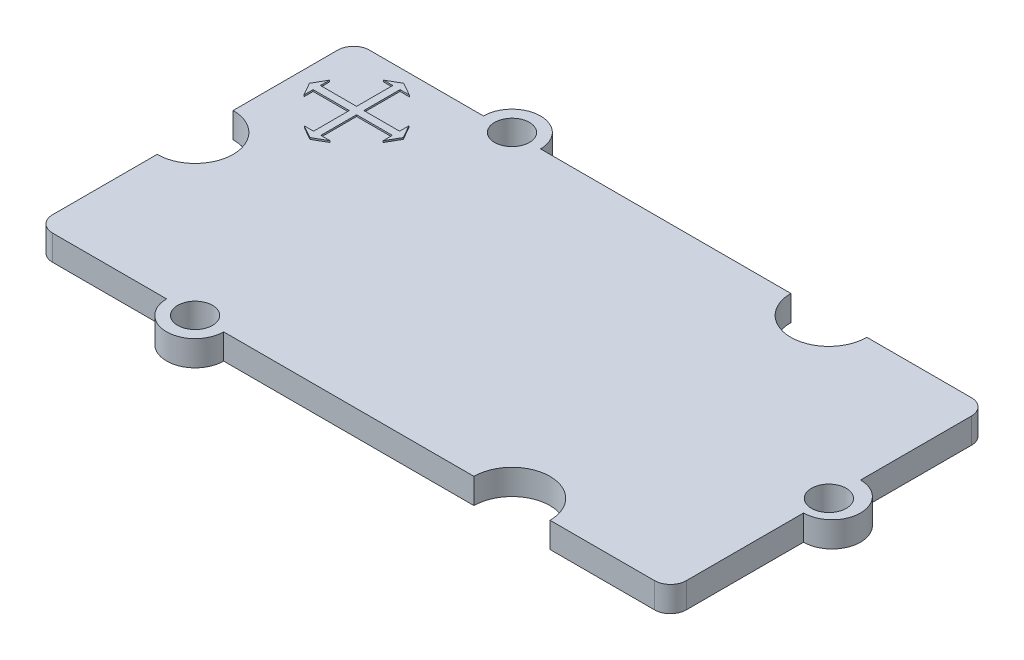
ISO-10303-21;
HEADER;
FILE_DESCRIPTION(('STEP AP214'),'2;1');
FILE_NAME('part.step','',(''),(''),'','','');
FILE_SCHEMA(('AUTOMOTIVE_DESIGN { 1 0 10303 214 1 1 1 1 }'));
ENDSEC;
DATA;
#1=APPLICATION_CONTEXT('core data for automotive mechanical design processes');
#2=APPLICATION_PROTOCOL_DEFINITION('international standard','automotive_design',2000,#1);
#3=PRODUCT_CONTEXT('',#1,'mechanical');
#4=PRODUCT('Part','Part','',(#3));
#5=PRODUCT_RELATED_PRODUCT_CATEGORY('part','',(#4));
#6=PRODUCT_DEFINITION_FORMATION('','',#4);
#7=PRODUCT_DEFINITION_CONTEXT('part definition',#1,'design');
#8=PRODUCT_DEFINITION('design','',#6,#7);
#9=PRODUCT_DEFINITION_SHAPE('','',#8);
#10=(LENGTH_UNIT() NAMED_UNIT(*) SI_UNIT(.MILLI.,.METRE.));
#11=(NAMED_UNIT(*) PLANE_ANGLE_UNIT() SI_UNIT($,.RADIAN.));
#12=(NAMED_UNIT(*) SI_UNIT($,.STERADIAN.) SOLID_ANGLE_UNIT());
#13=UNCERTAINTY_MEASURE_WITH_UNIT(LENGTH_MEASURE(1.E-05),#10,'distance_accuracy_value','');
#14=(GEOMETRIC_REPRESENTATION_CONTEXT(3) GLOBAL_UNCERTAINTY_ASSIGNED_CONTEXT((#13)) GLOBAL_UNIT_ASSIGNED_CONTEXT((#10,
#11,#12)) REPRESENTATION_CONTEXT('',''));
#15=CARTESIAN_POINT('',(0.,0.,0.));
#16=DIRECTION('',(0.,0.,1.));
#17=DIRECTION('',(1.,0.,0.));
#18=AXIS2_PLACEMENT_3D('',#15,#16,#17);
#19=CARTESIAN_POINT('',(-28.2997236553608,0.,1.));
#20=DIRECTION('',(0.,-1.,0.));
#21=DIRECTION('',(0.,0.,-1.));
#22=AXIS2_PLACEMENT_3D('',#19,#20,#21);
#23=PLANE('',#22);
#24=CARTESIAN_POINT('',(-27.2997236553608,0.,10.));
#25=DIRECTION('',(0.,-1.,0.));
#26=DIRECTION('',(0.,0.,1.));
#27=AXIS2_PLACEMENT_3D('',#24,#25,#26);
#28=CIRCLE('',#27,1.1);
#29=CARTESIAN_POINT('',(-27.2997236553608,0.,11.1));
#30=VERTEX_POINT('',#29);
#31=EDGE_CURVE('E398',#30,#30,#28,.T.);
#32=ORIENTED_EDGE('',*,*,#31,.T.);
#33=EDGE_LOOP('',(#32));
#34=FACE_BOUND('',#33,.T.);
#35=CARTESIAN_POINT('',(-57.2997236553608,0.,0.));
#36=DIRECTION('',(0.,-1.,0.));
#37=DIRECTION('',(0.,0.,-1.));
#38=AXIS2_PLACEMENT_3D('',#35,#36,#37);
#39=CIRCLE('',#38,1.1);
#40=CARTESIAN_POINT('',(-57.2997236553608,0.,-1.1));
#41=VERTEX_POINT('',#40);
#42=EDGE_CURVE('E410',#41,#41,#39,.T.);
#43=ORIENTED_EDGE('',*,*,#42,.T.);
#44=EDGE_LOOP('',(#43));
#45=FACE_BOUND('',#44,.T.);
#46=CARTESIAN_POINT('',(-28.2997236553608,0.,1.));
#47=DIRECTION('',(0.,-1.,0.));
#48=DIRECTION('',(0.,0.,-1.));
#49=AXIS2_PLACEMENT_3D('',#46,#47,#48);
#50=CIRCLE('',#49,0.999999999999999);
#51=CARTESIAN_POINT('',(-28.2997236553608,0.,0.));
#52=VERTEX_POINT('',#51);
#53=CARTESIAN_POINT('',(-27.2997236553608,0.,1.00000000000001));
#54=VERTEX_POINT('',#53);
#55=EDGE_CURVE('E416',#52,#54,#50,.T.);
#56=ORIENTED_EDGE('',*,*,#55,.F.);
#57=DIRECTION('',(1.,0.,0.));
#58=VECTOR('',#57,1.);
#59=CARTESIAN_POINT('',(-34.8997236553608,0.,0.));
#60=LINE('',#59,#58);
#61=CARTESIAN_POINT('',(-34.8997236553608,0.,0.));
#62=VERTEX_POINT('',#61);
#63=EDGE_CURVE('E455',#62,#52,#60,.T.);
#64=ORIENTED_EDGE('',*,*,#63,.F.);
#65=CARTESIAN_POINT('',(-37.2997236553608,0.,0.));
#66=DIRECTION('',(0.,1.,0.));
#67=DIRECTION('',(0.,0.,1.));
#68=AXIS2_PLACEMENT_3D('',#65,#66,#67);
#69=CIRCLE('',#68,2.4);
#70=CARTESIAN_POINT('',(-39.6997236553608,0.,0.));
#71=VERTEX_POINT('',#70);
#72=EDGE_CURVE('E453',#71,#62,#69,.T.);
#73=ORIENTED_EDGE('',*,*,#72,.F.);
#74=DIRECTION('',(1.,0.,0.));
#75=VECTOR('',#74,1.);
#76=CARTESIAN_POINT('',(-39.6997236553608,0.,0.));
#77=LINE('',#76,#75);
#78=CARTESIAN_POINT('',(-55.4997236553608,0.,0.));
#79=VERTEX_POINT('',#78);
#80=EDGE_CURVE('E451',#79,#71,#77,.T.);
#81=ORIENTED_EDGE('',*,*,#80,.F.);
#82=CARTESIAN_POINT('',(-57.2997236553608,0.,0.));
#83=DIRECTION('',(0.,-1.,0.));
#84=DIRECTION('',(0.,0.,1.));
#85=AXIS2_PLACEMENT_3D('',#82,#83,#84);
#86=CIRCLE('',#85,1.8);
#87=CARTESIAN_POINT('',(-59.0997236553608,0.,0.));
#88=VERTEX_POINT('',#87);
#89=EDGE_CURVE('E449',#88,#79,#86,.T.);
#90=ORIENTED_EDGE('',*,*,#89,.F.);
#91=DIRECTION('',(1.,0.,0.));
#92=VECTOR('',#91,1.);
#93=CARTESIAN_POINT('',(-59.0997236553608,0.,0.));
#94=LINE('',#93,#92);
#95=CARTESIAN_POINT('',(-66.2997236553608,0.,0.));
#96=VERTEX_POINT('',#95);
#97=EDGE_CURVE('E447',#96,#88,#94,.T.);
#98=ORIENTED_EDGE('',*,*,#97,.F.);
#99=CARTESIAN_POINT('',(-66.2997236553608,0.,1.));
#100=DIRECTION('',(0.,-1.,0.));
#101=DIRECTION('',(0.,0.,-1.));
#102=AXIS2_PLACEMENT_3D('',#99,#100,#101);
#103=CIRCLE('',#102,1.);
#104=CARTESIAN_POINT('',(-67.2997236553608,0.,1.00000000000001));
#105=VERTEX_POINT('',#104);
#106=EDGE_CURVE('E445',#105,#96,#103,.T.);
#107=ORIENTED_EDGE('',*,*,#106,.F.);
#108=DIRECTION('',(0.,0.,-1.));
#109=VECTOR('',#108,1.);
#110=CARTESIAN_POINT('',(-67.2997236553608,0.,7.60000000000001));
#111=LINE('',#110,#109);
#112=CARTESIAN_POINT('',(-67.2997236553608,0.,7.60000000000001));
#113=VERTEX_POINT('',#112);
#114=EDGE_CURVE('E443',#113,#105,#111,.T.);
#115=ORIENTED_EDGE('',*,*,#114,.F.);
#116=CARTESIAN_POINT('',(-67.2997236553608,0.,10.));
#117=DIRECTION('',(0.,1.,0.));
#118=DIRECTION('',(0.,0.,-1.));
#119=AXIS2_PLACEMENT_3D('',#116,#117,#118);
#120=CIRCLE('',#119,2.4);
#121=CARTESIAN_POINT('',(-67.2997236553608,0.,12.4));
#122=VERTEX_POINT('',#121);
#123=EDGE_CURVE('E441',#122,#113,#120,.T.);
#124=ORIENTED_EDGE('',*,*,#123,.F.);
#125=DIRECTION('',(0.,0.,-1.));
#126=VECTOR('',#125,1.);
#127=CARTESIAN_POINT('',(-67.2997236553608,0.,19.));
#128=LINE('',#127,#126);
#129=CARTESIAN_POINT('',(-67.2997236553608,0.,19.));
#130=VERTEX_POINT('',#129);
#131=EDGE_CURVE('E439',#130,#122,#128,.T.);
#132=ORIENTED_EDGE('',*,*,#131,.F.);
#133=CARTESIAN_POINT('',(-66.2997236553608,0.,19.));
#134=DIRECTION('',(0.,-1.,0.));
#135=DIRECTION('',(0.,0.,1.));
#136=AXIS2_PLACEMENT_3D('',#133,#134,#135);
#137=CIRCLE('',#136,1.);
#138=CARTESIAN_POINT('',(-66.2997236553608,0.,20.));
#139=VERTEX_POINT('',#138);
#140=EDGE_CURVE('E437',#139,#130,#137,.T.);
#141=ORIENTED_EDGE('',*,*,#140,.F.);
#142=DIRECTION('',(-1.,0.,0.));
#143=VECTOR('',#142,1.);
#144=CARTESIAN_POINT('',(-59.0997236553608,0.,20.));
#145=LINE('',#144,#143);
#146=CARTESIAN_POINT('',(-59.0997236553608,0.,20.));
#147=VERTEX_POINT('',#146);
#148=EDGE_CURVE('E435',#147,#139,#145,.T.);
#149=ORIENTED_EDGE('',*,*,#148,.F.);
#150=CARTESIAN_POINT('',(-57.2997236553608,0.,20.));
#151=DIRECTION('',(0.,-1.,0.));
#152=DIRECTION('',(0.,0.,-1.));
#153=AXIS2_PLACEMENT_3D('',#150,#151,#152);
#154=CIRCLE('',#153,1.80000000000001);
#155=CARTESIAN_POINT('',(-55.4997236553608,0.,20.));
#156=VERTEX_POINT('',#155);
#157=EDGE_CURVE('E433',#156,#147,#154,.T.);
#158=ORIENTED_EDGE('',*,*,#157,.F.);
#159=DIRECTION('',(-1.,0.,0.));
#160=VECTOR('',#159,1.);
#161=CARTESIAN_POINT('',(-39.6997236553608,0.,20.));
#162=LINE('',#161,#160);
#163=CARTESIAN_POINT('',(-39.6997236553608,0.,20.));
#164=VERTEX_POINT('',#163);
#165=EDGE_CURVE('E431',#164,#156,#162,.T.);
#166=ORIENTED_EDGE('',*,*,#165,.F.);
#167=CARTESIAN_POINT('',(-37.2997236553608,0.,20.));
#168=DIRECTION('',(0.,1.,0.));
#169=DIRECTION('',(0.,0.,-1.));
#170=AXIS2_PLACEMENT_3D('',#167,#168,#169);
#171=CIRCLE('',#170,2.4);
#172=CARTESIAN_POINT('',(-34.8997236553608,0.,20.));
#173=VERTEX_POINT('',#172);
#174=EDGE_CURVE('E429',#173,#164,#171,.T.);
#175=ORIENTED_EDGE('',*,*,#174,.F.);
#176=DIRECTION('',(-1.,0.,0.));
#177=VECTOR('',#176,1.);
#178=CARTESIAN_POINT('',(-34.8997236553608,0.,20.));
#179=LINE('',#178,#177);
#180=CARTESIAN_POINT('',(-28.2997236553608,0.,20.));
#181=VERTEX_POINT('',#180);
#182=EDGE_CURVE('E427',#181,#173,#179,.T.);
#183=ORIENTED_EDGE('',*,*,#182,.F.);
#184=CARTESIAN_POINT('',(-28.2997236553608,0.,19.));
#185=DIRECTION('',(0.,-1.,0.));
#186=DIRECTION('',(0.,0.,1.));
#187=AXIS2_PLACEMENT_3D('',#184,#185,#186);
#188=CIRCLE('',#187,0.999999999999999);
#189=CARTESIAN_POINT('',(-27.2997236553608,0.,19.));
#190=VERTEX_POINT('',#189);
#191=EDGE_CURVE('E425',#190,#181,#188,.T.);
#192=ORIENTED_EDGE('',*,*,#191,.F.);
#193=DIRECTION('',(0.,0.,1.));
#194=VECTOR('',#193,1.);
#195=CARTESIAN_POINT('',(-27.2997236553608,0.,19.));
#196=LINE('',#195,#194);
#197=CARTESIAN_POINT('',(-27.2997236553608,0.,11.6));
#198=VERTEX_POINT('',#197);
#199=EDGE_CURVE('E423',#198,#190,#196,.T.);
#200=ORIENTED_EDGE('',*,*,#199,.F.);
#201=CARTESIAN_POINT('',(-27.2997236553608,0.,9.8));
#202=DIRECTION('',(0.,-1.,0.));
#203=DIRECTION('',(0.,0.,1.));
#204=AXIS2_PLACEMENT_3D('',#201,#202,#203);
#205=CIRCLE('',#204,1.8);
#206=CARTESIAN_POINT('',(-27.2997236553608,0.,8.));
#207=VERTEX_POINT('',#206);
#208=EDGE_CURVE('E421',#207,#198,#205,.T.);
#209=ORIENTED_EDGE('',*,*,#208,.F.);
#210=DIRECTION('',(0.,0.,1.));
#211=VECTOR('',#210,1.);
#212=CARTESIAN_POINT('',(-27.2997236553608,0.,8.));
#213=LINE('',#212,#211);
#214=EDGE_CURVE('E419',#54,#207,#213,.T.);
#215=ORIENTED_EDGE('',*,*,#214,.F.);
#216=EDGE_LOOP('',(#56,#64,#73,#81,#90,#98,#107,#115,#124,#132,#141,#149,#158,#166,#175,#183,
#192,#200,#209,#215));
#217=FACE_BOUND('',#216,.T.);
#218=CARTESIAN_POINT('',(-57.2997236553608,0.,20.));
#219=DIRECTION('',(0.,-1.,0.));
#220=DIRECTION('',(0.,0.,1.));
#221=AXIS2_PLACEMENT_3D('',#218,#219,#220);
#222=CIRCLE('',#221,1.1);
#223=CARTESIAN_POINT('',(-57.2997236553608,0.,21.1));
#224=VERTEX_POINT('',#223);
#225=EDGE_CURVE('E404',#224,#224,#222,.T.);
#226=ORIENTED_EDGE('',*,*,#225,.T.);
#227=EDGE_LOOP('',(#226));
#228=FACE_BOUND('',#227,.T.);
#229=DIRECTION('',(0.,0.,-1.));
#230=VECTOR('',#229,1.);
#231=CARTESIAN_POINT('',(-63.0723154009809,0.,3.58098676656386));
#232=LINE('',#231,#230);
#233=CARTESIAN_POINT('',(-63.0723154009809,0.,3.58098676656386));
#234=VERTEX_POINT('',#233);
#235=CARTESIAN_POINT('',(-63.0723154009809,0.,1.29453565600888));
#236=VERTEX_POINT('',#235);
#237=EDGE_CURVE('E304',#234,#236,#232,.T.);
#238=ORIENTED_EDGE('',*,*,#237,.F.);
#239=DIRECTION('',(-1.,0.,0.));
#240=VECTOR('',#239,1.);
#241=CARTESIAN_POINT('',(-60.8135830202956,0.,3.58098676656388));
#242=LINE('',#241,#240);
#243=CARTESIAN_POINT('',(-60.8135830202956,0.,3.58098676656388));
#244=VERTEX_POINT('',#243);
#245=EDGE_CURVE('E306',#244,#234,#242,.T.);
#246=ORIENTED_EDGE('',*,*,#245,.F.);
#247=DIRECTION('',(0.,0.,1.));
#248=VECTOR('',#247,1.);
#249=CARTESIAN_POINT('',(-60.8135830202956,0.,2.99637977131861));
#250=LINE('',#249,#248);
#251=CARTESIAN_POINT('',(-60.8135830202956,0.,2.99637977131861));
#252=VERTEX_POINT('',#251);
#253=EDGE_CURVE('E322',#252,#244,#250,.T.);
#254=ORIENTED_EDGE('',*,*,#253,.F.);
#255=DIRECTION('',(-0.496181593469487,0.,-0.868218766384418));
#256=VECTOR('',#255,1.);
#257=CARTESIAN_POINT('',(-60.3495213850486,0.,3.80839502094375));
#258=LINE('',#257,#256);
#259=CARTESIAN_POINT('',(-60.3495213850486,0.,3.80839502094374));
#260=VERTEX_POINT('',#259);
#261=EDGE_CURVE('E1022',#260,#252,#258,.T.);
#262=ORIENTED_EDGE('',*,*,#261,.F.);
#263=DIRECTION('',(0.496181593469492,0.,-0.868218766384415));
#264=VECTOR('',#263,1.);
#265=CARTESIAN_POINT('',(-60.3495213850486,0.,3.80839502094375));
#266=LINE('',#265,#264);
#267=CARTESIAN_POINT('',(-60.8135830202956,0.,4.62041027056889));
#268=VERTEX_POINT('',#267);
#269=EDGE_CURVE('E1024',#268,#260,#266,.T.);
#270=ORIENTED_EDGE('',*,*,#269,.F.);
#271=DIRECTION('',(0.,0.,1.));
#272=VECTOR('',#271,1.);
#273=CARTESIAN_POINT('',(-60.8135830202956,0.,4.62041027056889));
#274=LINE('',#273,#272);
#275=CARTESIAN_POINT('',(-60.8135830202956,0.,4.03745132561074));
#276=VERTEX_POINT('',#275);
#277=EDGE_CURVE('E1029',#276,#268,#274,.T.);
#278=ORIENTED_EDGE('',*,*,#277,.F.);
#279=DIRECTION('',(1.,0.,0.));
#280=VECTOR('',#279,1.);
#281=CARTESIAN_POINT('',(-60.8135830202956,0.,4.03745132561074));
#282=LINE('',#281,#280);
#283=CARTESIAN_POINT('',(-63.0723154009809,0.,4.03745132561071));
#284=VERTEX_POINT('',#283);
#285=EDGE_CURVE('E1032',#284,#276,#282,.T.);
#286=ORIENTED_EDGE('',*,*,#285,.F.);
#287=DIRECTION('',(0.,0.,-1.));
#288=VECTOR('',#287,1.);
#289=CARTESIAN_POINT('',(-63.0723154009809,0.,4.03745132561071));
#290=LINE('',#289,#288);
#291=CARTESIAN_POINT('',(-63.0723154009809,0.,6.29453565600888));
#292=VERTEX_POINT('',#291);
#293=EDGE_CURVE('E1035',#292,#284,#290,.T.);
#294=ORIENTED_EDGE('',*,*,#293,.F.);
#295=DIRECTION('',(-1.,0.,0.));
#296=VECTOR('',#295,1.);
#297=CARTESIAN_POINT('',(-62.4877084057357,0.,6.29453565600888));
#298=LINE('',#297,#296);
#299=CARTESIAN_POINT('',(-62.4877084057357,0.,6.29453565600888));
#300=VERTEX_POINT('',#299);
#301=EDGE_CURVE('E1038',#300,#292,#298,.T.);
#302=ORIENTED_EDGE('',*,*,#301,.F.);
#303=DIRECTION('',(0.868218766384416,0.,-0.49618159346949));
#304=VECTOR('',#303,1.);
#305=CARTESIAN_POINT('',(-63.2997236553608,0.,6.75859729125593));
#306=LINE('',#305,#304);
#307=CARTESIAN_POINT('',(-63.2997236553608,0.,6.75859729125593));
#308=VERTEX_POINT('',#307);
#309=EDGE_CURVE('E1041',#308,#300,#306,.T.);
#310=ORIENTED_EDGE('',*,*,#309,.F.);
#311=DIRECTION('',(0.868218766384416,0.,0.49618159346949));
#312=VECTOR('',#311,1.);
#313=CARTESIAN_POINT('',(-63.2997236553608,0.,6.75859729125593));
#314=LINE('',#313,#312);
#315=CARTESIAN_POINT('',(-64.1117389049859,0.,6.29453565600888));
#316=VERTEX_POINT('',#315);
#317=EDGE_CURVE('E1044',#316,#308,#314,.T.);
#318=ORIENTED_EDGE('',*,*,#317,.F.);
#319=DIRECTION('',(-1.,0.,0.));
#320=VECTOR('',#319,1.);
#321=CARTESIAN_POINT('',(-64.1117389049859,0.,6.29453565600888));
#322=LINE('',#321,#320);
#323=CARTESIAN_POINT('',(-63.5287799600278,0.,6.29453565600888));
#324=VERTEX_POINT('',#323);
#325=EDGE_CURVE('E1047',#324,#316,#322,.T.);
#326=ORIENTED_EDGE('',*,*,#325,.F.);
#327=DIRECTION('',(0.,0.,1.));
#328=VECTOR('',#327,1.);
#329=CARTESIAN_POINT('',(-63.5287799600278,0.,4.03745132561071));
#330=LINE('',#329,#328);
#331=CARTESIAN_POINT('',(-63.5287799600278,0.,4.03745132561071));
#332=VERTEX_POINT('',#331);
#333=EDGE_CURVE('E1050',#332,#324,#330,.T.);
#334=ORIENTED_EDGE('',*,*,#333,.F.);
#335=DIRECTION('',(1.,0.,0.));
#336=VECTOR('',#335,1.);
#337=CARTESIAN_POINT('',(-65.8135830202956,0.,4.0374513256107));
#338=LINE('',#337,#336);
#339=CARTESIAN_POINT('',(-65.8135830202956,0.,4.0374513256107));
#340=VERTEX_POINT('',#339);
#341=EDGE_CURVE('E1053',#340,#332,#338,.T.);
#342=ORIENTED_EDGE('',*,*,#341,.F.);
#343=DIRECTION('',(0.,0.,-1.));
#344=VECTOR('',#343,1.);
#345=CARTESIAN_POINT('',(-65.8135830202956,0.,4.62041027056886));
#346=LINE('',#345,#344);
#347=CARTESIAN_POINT('',(-65.8135830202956,0.,4.62041027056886));
#348=VERTEX_POINT('',#347);
#349=EDGE_CURVE('E1056',#348,#340,#346,.T.);
#350=ORIENTED_EDGE('',*,*,#349,.F.);
#351=DIRECTION('',(0.496181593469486,0.,0.868218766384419));
#352=VECTOR('',#351,1.);
#353=CARTESIAN_POINT('',(-66.2776446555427,0.,3.8083950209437));
#354=LINE('',#353,#352);
#355=CARTESIAN_POINT('',(-66.2776446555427,0.,3.80839502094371));
#356=VERTEX_POINT('',#355);
#357=EDGE_CURVE('E1059',#356,#348,#354,.T.);
#358=ORIENTED_EDGE('',*,*,#357,.F.);
#359=DIRECTION('',(-0.496181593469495,0.,0.868218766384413));
#360=VECTOR('',#359,1.);
#361=CARTESIAN_POINT('',(-66.2776446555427,0.,3.8083950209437));
#362=LINE('',#361,#360);
#363=CARTESIAN_POINT('',(-65.8135830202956,0.,2.99637977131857));
#364=VERTEX_POINT('',#363);
#365=EDGE_CURVE('E1062',#364,#356,#362,.T.);
#366=ORIENTED_EDGE('',*,*,#365,.F.);
#367=DIRECTION('',(0.,0.,-1.));
#368=VECTOR('',#367,1.);
#369=CARTESIAN_POINT('',(-65.8135830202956,0.,2.99637977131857));
#370=LINE('',#369,#368);
#371=CARTESIAN_POINT('',(-65.8135830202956,0.,3.58098676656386));
#372=VERTEX_POINT('',#371);
#373=EDGE_CURVE('E1065',#372,#364,#370,.T.);
#374=ORIENTED_EDGE('',*,*,#373,.F.);
#375=DIRECTION('',(-1.,0.,0.));
#376=VECTOR('',#375,1.);
#377=CARTESIAN_POINT('',(-65.8135830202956,0.,3.58098676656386));
#378=LINE('',#377,#376);
#379=CARTESIAN_POINT('',(-63.5287799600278,0.,3.58098676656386));
#380=VERTEX_POINT('',#379);
#381=EDGE_CURVE('E1068',#380,#372,#378,.T.);
#382=ORIENTED_EDGE('',*,*,#381,.F.);
#383=DIRECTION('',(0.,0.,1.));
#384=VECTOR('',#383,1.);
#385=CARTESIAN_POINT('',(-63.5287799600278,0.,1.29453565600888));
#386=LINE('',#385,#384);
#387=CARTESIAN_POINT('',(-63.5287799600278,0.,1.29453565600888));
#388=VERTEX_POINT('',#387);
#389=EDGE_CURVE('E1071',#388,#380,#386,.T.);
#390=ORIENTED_EDGE('',*,*,#389,.F.);
#391=DIRECTION('',(1.,0.,0.));
#392=VECTOR('',#391,1.);
#393=CARTESIAN_POINT('',(-64.1117389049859,0.,1.29453565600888));
#394=LINE('',#393,#392);
#395=CARTESIAN_POINT('',(-64.1117389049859,0.,1.29453565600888));
#396=VERTEX_POINT('',#395);
#397=EDGE_CURVE('E1074',#396,#388,#394,.T.);
#398=ORIENTED_EDGE('',*,*,#397,.F.);
#399=DIRECTION('',(-0.868218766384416,0.,0.49618159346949));
#400=VECTOR('',#399,1.);
#401=CARTESIAN_POINT('',(-63.2997236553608,0.,0.830474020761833));
#402=LINE('',#401,#400);
#403=CARTESIAN_POINT('',(-63.2997236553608,0.,0.830474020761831));
#404=VERTEX_POINT('',#403);
#405=EDGE_CURVE('E1077',#404,#396,#402,.T.);
#406=ORIENTED_EDGE('',*,*,#405,.F.);
#407=DIRECTION('',(-0.868218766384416,0.,-0.49618159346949));
#408=VECTOR('',#407,1.);
#409=CARTESIAN_POINT('',(-63.2997236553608,0.,0.830474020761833));
#410=LINE('',#409,#408);
#411=CARTESIAN_POINT('',(-62.4877084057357,0.,1.29453565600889));
#412=VERTEX_POINT('',#411);
#413=EDGE_CURVE('E47',#412,#404,#410,.T.);
#414=ORIENTED_EDGE('',*,*,#413,.F.);
#415=DIRECTION('',(1.,0.,0.));
#416=VECTOR('',#415,1.);
#417=CARTESIAN_POINT('',(-62.4877084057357,0.,1.29453565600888));
#418=LINE('',#417,#416);
#419=EDGE_CURVE('E42',#236,#412,#418,.T.);
#420=ORIENTED_EDGE('',*,*,#419,.F.);
#421=EDGE_LOOP('',(#238,#246,#254,#262,#270,#278,#286,#294,#302,#310,#318,#326,#334,#342,#350,
#358,#366,#374,#382,#390,#398,#406,#414,#420));
#422=FACE_BOUND('',#421,.T.);
#423=ADVANCED_FACE('F27',(#34,#45,#217,#228,#422),#23,.F.);
#424=CARTESIAN_POINT('',(-28.2997236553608,-1.6,1.));
#425=DIRECTION('',(0.,-1.,0.));
#426=DIRECTION('',(0.,0.,-1.));
#427=AXIS2_PLACEMENT_3D('',#424,#425,#426);
#428=PLANE('',#427);
#429=CARTESIAN_POINT('',(-57.2997236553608,-1.6,20.));
#430=DIRECTION('',(0.,-1.,0.));
#431=DIRECTION('',(0.,0.,1.));
#432=AXIS2_PLACEMENT_3D('',#429,#430,#431);
#433=CIRCLE('',#432,1.1);
#434=CARTESIAN_POINT('',(-57.2997236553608,-1.6,21.1));
#435=VERTEX_POINT('',#434);
#436=EDGE_CURVE('E407',#435,#435,#433,.T.);
#437=ORIENTED_EDGE('',*,*,#436,.F.);
#438=EDGE_LOOP('',(#437));
#439=FACE_BOUND('',#438,.T.);
#440=CARTESIAN_POINT('',(-28.2997236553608,-1.6,1.));
#441=DIRECTION('',(0.,-1.,0.));
#442=DIRECTION('',(0.,0.,-1.));
#443=AXIS2_PLACEMENT_3D('',#440,#441,#442);
#444=CIRCLE('',#443,0.999999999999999);
#445=CARTESIAN_POINT('',(-28.2997236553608,-1.6,0.));
#446=VERTEX_POINT('',#445);
#447=CARTESIAN_POINT('',(-27.2997236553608,-1.6,1.00000000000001));
#448=VERTEX_POINT('',#447);
#449=EDGE_CURVE('E457',#446,#448,#444,.T.);
#450=ORIENTED_EDGE('',*,*,#449,.T.);
#451=DIRECTION('',(0.,0.,1.));
#452=VECTOR('',#451,1.);
#453=CARTESIAN_POINT('',(-27.2997236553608,-1.6,8.));
#454=LINE('',#453,#452);
#455=CARTESIAN_POINT('',(-27.2997236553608,-1.6,8.));
#456=VERTEX_POINT('',#455);
#457=EDGE_CURVE('E460',#448,#456,#454,.T.);
#458=ORIENTED_EDGE('',*,*,#457,.T.);
#459=CARTESIAN_POINT('',(-27.2997236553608,-1.6,9.8));
#460=DIRECTION('',(0.,-1.,0.));
#461=DIRECTION('',(0.,0.,1.));
#462=AXIS2_PLACEMENT_3D('',#459,#460,#461);
#463=CIRCLE('',#462,1.8);
#464=CARTESIAN_POINT('',(-27.2997236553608,-1.6,11.6));
#465=VERTEX_POINT('',#464);
#466=EDGE_CURVE('E462',#456,#465,#463,.T.);
#467=ORIENTED_EDGE('',*,*,#466,.T.);
#468=DIRECTION('',(0.,0.,1.));
#469=VECTOR('',#468,1.);
#470=CARTESIAN_POINT('',(-27.2997236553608,-1.6,19.));
#471=LINE('',#470,#469);
#472=CARTESIAN_POINT('',(-27.2997236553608,-1.6,19.));
#473=VERTEX_POINT('',#472);
#474=EDGE_CURVE('E464',#465,#473,#471,.T.);
#475=ORIENTED_EDGE('',*,*,#474,.T.);
#476=CARTESIAN_POINT('',(-28.2997236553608,-1.6,19.));
#477=DIRECTION('',(0.,-1.,0.));
#478=DIRECTION('',(0.,0.,1.));
#479=AXIS2_PLACEMENT_3D('',#476,#477,#478);
#480=CIRCLE('',#479,0.999999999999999);
#481=CARTESIAN_POINT('',(-28.2997236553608,-1.6,20.));
#482=VERTEX_POINT('',#481);
#483=EDGE_CURVE('E466',#473,#482,#480,.T.);
#484=ORIENTED_EDGE('',*,*,#483,.T.);
#485=DIRECTION('',(-1.,0.,0.));
#486=VECTOR('',#485,1.);
#487=CARTESIAN_POINT('',(-34.8997236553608,-1.6,20.));
#488=LINE('',#487,#486);
#489=CARTESIAN_POINT('',(-34.8997236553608,-1.6,20.));
#490=VERTEX_POINT('',#489);
#491=EDGE_CURVE('E468',#482,#490,#488,.T.);
#492=ORIENTED_EDGE('',*,*,#491,.T.);
#493=CARTESIAN_POINT('',(-37.2997236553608,-1.6,20.));
#494=DIRECTION('',(0.,1.,0.));
#495=DIRECTION('',(0.,0.,-1.));
#496=AXIS2_PLACEMENT_3D('',#493,#494,#495);
#497=CIRCLE('',#496,2.4);
#498=CARTESIAN_POINT('',(-39.6997236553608,-1.6,20.));
#499=VERTEX_POINT('',#498);
#500=EDGE_CURVE('E470',#490,#499,#497,.T.);
#501=ORIENTED_EDGE('',*,*,#500,.T.);
#502=DIRECTION('',(-1.,0.,0.));
#503=VECTOR('',#502,1.);
#504=CARTESIAN_POINT('',(-39.6997236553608,-1.6,20.));
#505=LINE('',#504,#503);
#506=CARTESIAN_POINT('',(-55.4997236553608,-1.6,20.));
#507=VERTEX_POINT('',#506);
#508=EDGE_CURVE('E472',#499,#507,#505,.T.);
#509=ORIENTED_EDGE('',*,*,#508,.T.);
#510=CARTESIAN_POINT('',(-57.2997236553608,-1.6,20.));
#511=DIRECTION('',(0.,-1.,0.));
#512=DIRECTION('',(0.,0.,-1.));
#513=AXIS2_PLACEMENT_3D('',#510,#511,#512);
#514=CIRCLE('',#513,1.80000000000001);
#515=CARTESIAN_POINT('',(-59.0997236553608,-1.6,20.));
#516=VERTEX_POINT('',#515);
#517=EDGE_CURVE('E474',#507,#516,#514,.T.);
#518=ORIENTED_EDGE('',*,*,#517,.T.);
#519=DIRECTION('',(-1.,0.,0.));
#520=VECTOR('',#519,1.);
#521=CARTESIAN_POINT('',(-59.0997236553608,-1.6,20.));
#522=LINE('',#521,#520);
#523=CARTESIAN_POINT('',(-66.2997236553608,-1.6,20.));
#524=VERTEX_POINT('',#523);
#525=EDGE_CURVE('E476',#516,#524,#522,.T.);
#526=ORIENTED_EDGE('',*,*,#525,.T.);
#527=CARTESIAN_POINT('',(-66.2997236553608,-1.6,19.));
#528=DIRECTION('',(0.,-1.,0.));
#529=DIRECTION('',(0.,0.,1.));
#530=AXIS2_PLACEMENT_3D('',#527,#528,#529);
#531=CIRCLE('',#530,1.);
#532=CARTESIAN_POINT('',(-67.2997236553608,-1.6,19.));
#533=VERTEX_POINT('',#532);
#534=EDGE_CURVE('E478',#524,#533,#531,.T.);
#535=ORIENTED_EDGE('',*,*,#534,.T.);
#536=DIRECTION('',(0.,0.,-1.));
#537=VECTOR('',#536,1.);
#538=CARTESIAN_POINT('',(-67.2997236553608,-1.6,19.));
#539=LINE('',#538,#537);
#540=CARTESIAN_POINT('',(-67.2997236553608,-1.6,12.4));
#541=VERTEX_POINT('',#540);
#542=EDGE_CURVE('E480',#533,#541,#539,.T.);
#543=ORIENTED_EDGE('',*,*,#542,.T.);
#544=CARTESIAN_POINT('',(-67.2997236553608,-1.6,10.));
#545=DIRECTION('',(0.,1.,0.));
#546=DIRECTION('',(0.,0.,-1.));
#547=AXIS2_PLACEMENT_3D('',#544,#545,#546);
#548=CIRCLE('',#547,2.4);
#549=CARTESIAN_POINT('',(-67.2997236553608,-1.6,7.60000000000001));
#550=VERTEX_POINT('',#549);
#551=EDGE_CURVE('E482',#541,#550,#548,.T.);
#552=ORIENTED_EDGE('',*,*,#551,.T.);
#553=DIRECTION('',(0.,0.,-1.));
#554=VECTOR('',#553,1.);
#555=CARTESIAN_POINT('',(-67.2997236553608,-1.6,7.60000000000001));
#556=LINE('',#555,#554);
#557=CARTESIAN_POINT('',(-67.2997236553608,-1.6,1.00000000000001));
#558=VERTEX_POINT('',#557);
#559=EDGE_CURVE('E484',#550,#558,#556,.T.);
#560=ORIENTED_EDGE('',*,*,#559,.T.);
#561=CARTESIAN_POINT('',(-66.2997236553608,-1.6,1.));
#562=DIRECTION('',(0.,-1.,0.));
#563=DIRECTION('',(0.,0.,-1.));
#564=AXIS2_PLACEMENT_3D('',#561,#562,#563);
#565=CIRCLE('',#564,1.);
#566=CARTESIAN_POINT('',(-66.2997236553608,-1.6,0.));
#567=VERTEX_POINT('',#566);
#568=EDGE_CURVE('E486',#558,#567,#565,.T.);
#569=ORIENTED_EDGE('',*,*,#568,.T.);
#570=DIRECTION('',(1.,0.,0.));
#571=VECTOR('',#570,1.);
#572=CARTESIAN_POINT('',(-59.0997236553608,-1.6,0.));
#573=LINE('',#572,#571);
#574=CARTESIAN_POINT('',(-59.0997236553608,-1.6,0.));
#575=VERTEX_POINT('',#574);
#576=EDGE_CURVE('E488',#567,#575,#573,.T.);
#577=ORIENTED_EDGE('',*,*,#576,.T.);
#578=CARTESIAN_POINT('',(-57.2997236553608,-1.6,0.));
#579=DIRECTION('',(0.,-1.,0.));
#580=DIRECTION('',(0.,0.,1.));
#581=AXIS2_PLACEMENT_3D('',#578,#579,#580);
#582=CIRCLE('',#581,1.8);
#583=CARTESIAN_POINT('',(-55.4997236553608,-1.6,0.));
#584=VERTEX_POINT('',#583);
#585=EDGE_CURVE('E490',#575,#584,#582,.T.);
#586=ORIENTED_EDGE('',*,*,#585,.T.);
#587=DIRECTION('',(1.,0.,0.));
#588=VECTOR('',#587,1.);
#589=CARTESIAN_POINT('',(-39.6997236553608,-1.6,0.));
#590=LINE('',#589,#588);
#591=CARTESIAN_POINT('',(-39.6997236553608,-1.6,0.));
#592=VERTEX_POINT('',#591);
#593=EDGE_CURVE('E492',#584,#592,#590,.T.);
#594=ORIENTED_EDGE('',*,*,#593,.T.);
#595=CARTESIAN_POINT('',(-37.2997236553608,-1.6,0.));
#596=DIRECTION('',(0.,1.,0.));
#597=DIRECTION('',(0.,0.,1.));
#598=AXIS2_PLACEMENT_3D('',#595,#596,#597);
#599=CIRCLE('',#598,2.4);
#600=CARTESIAN_POINT('',(-34.8997236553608,-1.6,0.));
#601=VERTEX_POINT('',#600);
#602=EDGE_CURVE('E494',#592,#601,#599,.T.);
#603=ORIENTED_EDGE('',*,*,#602,.T.);
#604=DIRECTION('',(1.,0.,0.));
#605=VECTOR('',#604,1.);
#606=CARTESIAN_POINT('',(-34.8997236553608,-1.6,0.));
#607=LINE('',#606,#605);
#608=EDGE_CURVE('E496',#601,#446,#607,.T.);
#609=ORIENTED_EDGE('',*,*,#608,.T.);
#610=EDGE_LOOP('',(#450,#458,#467,#475,#484,#492,#501,#509,#518,#526,#535,#543,#552,#560,#569,
#577,#586,#594,#603,#609));
#611=FACE_BOUND('',#610,.T.);
#612=CARTESIAN_POINT('',(-57.2997236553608,-1.6,0.));
#613=DIRECTION('',(0.,-1.,0.));
#614=DIRECTION('',(0.,0.,-1.));
#615=AXIS2_PLACEMENT_3D('',#612,#613,#614);
#616=CIRCLE('',#615,1.1);
#617=CARTESIAN_POINT('',(-57.2997236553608,-1.6,-1.1));
#618=VERTEX_POINT('',#617);
#619=EDGE_CURVE('E413',#618,#618,#616,.T.);
#620=ORIENTED_EDGE('',*,*,#619,.F.);
#621=EDGE_LOOP('',(#620));
#622=FACE_BOUND('',#621,.T.);
#623=CARTESIAN_POINT('',(-27.2997236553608,-1.6,10.));
#624=DIRECTION('',(0.,-1.,0.));
#625=DIRECTION('',(0.,0.,1.));
#626=AXIS2_PLACEMENT_3D('',#623,#624,#625);
#627=CIRCLE('',#626,1.1);
#628=CARTESIAN_POINT('',(-27.2997236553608,-1.6,11.1));
#629=VERTEX_POINT('',#628);
#630=EDGE_CURVE('E401',#629,#629,#627,.T.);
#631=ORIENTED_EDGE('',*,*,#630,.F.);
#632=EDGE_LOOP('',(#631));
#633=FACE_BOUND('',#632,.T.);
#634=ADVANCED_FACE('F575',(#439,#611,#622,#633),#428,.T.);
#635=CARTESIAN_POINT('',(-28.2997236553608,-1.6,1.));
#636=DIRECTION('',(0.,1.,0.));
#637=DIRECTION('',(0.,0.,1.));
#638=AXIS2_PLACEMENT_3D('',#635,#636,#637);
#639=CYLINDRICAL_SURFACE('',#638,0.999999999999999);
#640=ORIENTED_EDGE('',*,*,#55,.T.);
#641=DIRECTION('',(0.,1.,0.));
#642=VECTOR('',#641,1.);
#643=CARTESIAN_POINT('',(-27.2997236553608,-1.6,1.00000000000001));
#644=LINE('',#643,#642);
#645=EDGE_CURVE('E11',#448,#54,#644,.T.);
#646=ORIENTED_EDGE('',*,*,#645,.F.);
#647=ORIENTED_EDGE('',*,*,#449,.F.);
#648=DIRECTION('',(0.,1.,0.));
#649=VECTOR('',#648,1.);
#650=CARTESIAN_POINT('',(-28.2997236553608,-1.6,0.));
#651=LINE('',#650,#649);
#652=EDGE_CURVE('E498',#446,#52,#651,.T.);
#653=ORIENTED_EDGE('',*,*,#652,.T.);
#654=EDGE_LOOP('',(#640,#646,#647,#653));
#655=FACE_BOUND('',#654,.T.);
#656=ADVANCED_FACE('F29',(#655),#639,.T.);
#657=CARTESIAN_POINT('',(-27.2997236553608,-1.6,8.));
#658=DIRECTION('',(-1.,0.,0.));
#659=DIRECTION('',(0.,0.,1.));
#660=AXIS2_PLACEMENT_3D('',#657,#658,#659);
#661=PLANE('',#660);
#662=ORIENTED_EDGE('',*,*,#214,.T.);
#663=DIRECTION('',(0.,1.,0.));
#664=VECTOR('',#663,1.);
#665=CARTESIAN_POINT('',(-27.2997236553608,-1.6,8.));
#666=LINE('',#665,#664);
#667=EDGE_CURVE('E35',#456,#207,#666,.T.);
#668=ORIENTED_EDGE('',*,*,#667,.F.);
#669=ORIENTED_EDGE('',*,*,#457,.F.);
#670=ORIENTED_EDGE('',*,*,#645,.T.);
#671=EDGE_LOOP('',(#662,#668,#669,#670));
#672=FACE_BOUND('',#671,.T.);
#673=ADVANCED_FACE('F580',(#672),#661,.F.);
#674=CARTESIAN_POINT('',(-27.2997236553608,-1.6,9.8));
#675=DIRECTION('',(0.,1.,0.));
#676=DIRECTION('',(0.,0.,1.));
#677=AXIS2_PLACEMENT_3D('',#674,#675,#676);
#678=CYLINDRICAL_SURFACE('',#677,1.8);
#679=ORIENTED_EDGE('',*,*,#208,.T.);
#680=DIRECTION('',(0.,1.,0.));
#681=VECTOR('',#680,1.);
#682=CARTESIAN_POINT('',(-27.2997236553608,-1.6,11.6));
#683=LINE('',#682,#681);
#684=EDGE_CURVE('E549',#465,#198,#683,.T.);
#685=ORIENTED_EDGE('',*,*,#684,.F.);
#686=ORIENTED_EDGE('',*,*,#466,.F.);
#687=ORIENTED_EDGE('',*,*,#667,.T.);
#688=EDGE_LOOP('',(#679,#685,#686,#687));
#689=FACE_BOUND('',#688,.T.);
#690=ADVANCED_FACE('F556',(#689),#678,.T.);
#691=CARTESIAN_POINT('',(-27.2997236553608,-1.6,19.));
#692=DIRECTION('',(-1.,0.,0.));
#693=DIRECTION('',(0.,0.,1.));
#694=AXIS2_PLACEMENT_3D('',#691,#692,#693);
#695=PLANE('',#694);
#696=ORIENTED_EDGE('',*,*,#199,.T.);
#697=DIRECTION('',(0.,1.,0.));
#698=VECTOR('',#697,1.);
#699=CARTESIAN_POINT('',(-27.2997236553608,-1.6,19.));
#700=LINE('',#699,#698);
#701=EDGE_CURVE('E546',#473,#190,#700,.T.);
#702=ORIENTED_EDGE('',*,*,#701,.F.);
#703=ORIENTED_EDGE('',*,*,#474,.F.);
#704=ORIENTED_EDGE('',*,*,#684,.T.);
#705=EDGE_LOOP('',(#696,#702,#703,#704));
#706=FACE_BOUND('',#705,.T.);
#707=ADVANCED_FACE('F567',(#706),#695,.F.);
#708=CARTESIAN_POINT('',(-28.2997236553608,-1.6,19.));
#709=DIRECTION('',(0.,1.,0.));
#710=DIRECTION('',(0.,0.,1.));
#711=AXIS2_PLACEMENT_3D('',#708,#709,#710);
#712=CYLINDRICAL_SURFACE('',#711,0.999999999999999);
#713=ORIENTED_EDGE('',*,*,#191,.T.);
#714=DIRECTION('',(0.,1.,0.));
#715=VECTOR('',#714,1.);
#716=CARTESIAN_POINT('',(-28.2997236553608,-1.6,20.));
#717=LINE('',#716,#715);
#718=EDGE_CURVE('E543',#482,#181,#717,.T.);
#719=ORIENTED_EDGE('',*,*,#718,.F.);
#720=ORIENTED_EDGE('',*,*,#483,.F.);
#721=ORIENTED_EDGE('',*,*,#701,.T.);
#722=EDGE_LOOP('',(#713,#719,#720,#721));
#723=FACE_BOUND('',#722,.T.);
#724=ADVANCED_FACE('F571',(#723),#712,.T.);
#725=CARTESIAN_POINT('',(-34.8997236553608,-1.6,20.));
#726=DIRECTION('',(0.,0.,-1.));
#727=DIRECTION('',(-1.,0.,0.));
#728=AXIS2_PLACEMENT_3D('',#725,#726,#727);
#729=PLANE('',#728);
#730=ORIENTED_EDGE('',*,*,#182,.T.);
#731=DIRECTION('',(0.,1.,0.));
#732=VECTOR('',#731,1.);
#733=CARTESIAN_POINT('',(-34.8997236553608,-1.6,20.));
#734=LINE('',#733,#732);
#735=EDGE_CURVE('E540',#490,#173,#734,.T.);
#736=ORIENTED_EDGE('',*,*,#735,.F.);
#737=ORIENTED_EDGE('',*,*,#491,.F.);
#738=ORIENTED_EDGE('',*,*,#718,.T.);
#739=EDGE_LOOP('',(#730,#736,#737,#738));
#740=FACE_BOUND('',#739,.T.);
#741=ADVANCED_FACE('F653',(#740),#729,.F.);
#742=CARTESIAN_POINT('',(-37.2997236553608,-1.6,20.));
#743=DIRECTION('',(0.,1.,0.));
#744=DIRECTION('',(0.,0.,1.));
#745=AXIS2_PLACEMENT_3D('',#742,#743,#744);
#746=CYLINDRICAL_SURFACE('',#745,2.4);
#747=ORIENTED_EDGE('',*,*,#174,.T.);
#748=DIRECTION('',(0.,1.,0.));
#749=VECTOR('',#748,1.);
#750=CARTESIAN_POINT('',(-39.6997236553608,-1.6,20.));
#751=LINE('',#750,#749);
#752=EDGE_CURVE('E537',#499,#164,#751,.T.);
#753=ORIENTED_EDGE('',*,*,#752,.F.);
#754=ORIENTED_EDGE('',*,*,#500,.F.);
#755=ORIENTED_EDGE('',*,*,#735,.T.);
#756=EDGE_LOOP('',(#747,#753,#754,#755));
#757=FACE_BOUND('',#756,.T.);
#758=ADVANCED_FACE('F651',(#757),#746,.F.);
#759=CARTESIAN_POINT('',(-39.6997236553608,-1.6,20.));
#760=DIRECTION('',(0.,0.,-1.));
#761=DIRECTION('',(-1.,0.,0.));
#762=AXIS2_PLACEMENT_3D('',#759,#760,#761);
#763=PLANE('',#762);
#764=ORIENTED_EDGE('',*,*,#165,.T.);
#765=DIRECTION('',(0.,1.,0.));
#766=VECTOR('',#765,1.);
#767=CARTESIAN_POINT('',(-55.4997236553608,-1.6,20.));
#768=LINE('',#767,#766);
#769=EDGE_CURVE('E534',#507,#156,#768,.T.);
#770=ORIENTED_EDGE('',*,*,#769,.F.);
#771=ORIENTED_EDGE('',*,*,#508,.F.);
#772=ORIENTED_EDGE('',*,*,#752,.T.);
#773=EDGE_LOOP('',(#764,#770,#771,#772));
#774=FACE_BOUND('',#773,.T.);
#775=ADVANCED_FACE('F646',(#774),#763,.F.);
#776=CARTESIAN_POINT('',(-57.2997236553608,-1.6,20.));
#777=DIRECTION('',(0.,1.,0.));
#778=DIRECTION('',(0.,0.,1.));
#779=AXIS2_PLACEMENT_3D('',#776,#777,#778);
#780=CYLINDRICAL_SURFACE('',#779,1.80000000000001);
#781=ORIENTED_EDGE('',*,*,#157,.T.);
#782=DIRECTION('',(0.,1.,0.));
#783=VECTOR('',#782,1.);
#784=CARTESIAN_POINT('',(-59.0997236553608,-1.6,20.));
#785=LINE('',#784,#783);
#786=EDGE_CURVE('E531',#516,#147,#785,.T.);
#787=ORIENTED_EDGE('',*,*,#786,.F.);
#788=ORIENTED_EDGE('',*,*,#517,.F.);
#789=ORIENTED_EDGE('',*,*,#769,.T.);
#790=EDGE_LOOP('',(#781,#787,#788,#789));
#791=FACE_BOUND('',#790,.T.);
#792=ADVANCED_FACE('F641',(#791),#780,.T.);
#793=CARTESIAN_POINT('',(-59.0997236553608,-1.6,20.));
#794=DIRECTION('',(0.,0.,-1.));
#795=DIRECTION('',(-1.,0.,0.));
#796=AXIS2_PLACEMENT_3D('',#793,#794,#795);
#797=PLANE('',#796);
#798=ORIENTED_EDGE('',*,*,#148,.T.);
#799=DIRECTION('',(0.,1.,0.));
#800=VECTOR('',#799,1.);
#801=CARTESIAN_POINT('',(-66.2997236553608,-1.6,20.));
#802=LINE('',#801,#800);
#803=EDGE_CURVE('E528',#524,#139,#802,.T.);
#804=ORIENTED_EDGE('',*,*,#803,.F.);
#805=ORIENTED_EDGE('',*,*,#525,.F.);
#806=ORIENTED_EDGE('',*,*,#786,.T.);
#807=EDGE_LOOP('',(#798,#804,#805,#806));
#808=FACE_BOUND('',#807,.T.);
#809=ADVANCED_FACE('F637',(#808),#797,.F.);
#810=CARTESIAN_POINT('',(-66.2997236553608,-1.6,19.));
#811=DIRECTION('',(0.,1.,0.));
#812=DIRECTION('',(0.,0.,1.));
#813=AXIS2_PLACEMENT_3D('',#810,#811,#812);
#814=CYLINDRICAL_SURFACE('',#813,1.);
#815=ORIENTED_EDGE('',*,*,#140,.T.);
#816=DIRECTION('',(0.,1.,0.));
#817=VECTOR('',#816,1.);
#818=CARTESIAN_POINT('',(-67.2997236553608,-1.6,19.));
#819=LINE('',#818,#817);
#820=EDGE_CURVE('E525',#533,#130,#819,.T.);
#821=ORIENTED_EDGE('',*,*,#820,.F.);
#822=ORIENTED_EDGE('',*,*,#534,.F.);
#823=ORIENTED_EDGE('',*,*,#803,.T.);
#824=EDGE_LOOP('',(#815,#821,#822,#823));
#825=FACE_BOUND('',#824,.T.);
#826=ADVANCED_FACE('F632',(#825),#814,.T.);
#827=CARTESIAN_POINT('',(-67.2997236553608,-1.6,19.));
#828=DIRECTION('',(1.,0.,0.));
#829=DIRECTION('',(0.,0.,-1.));
#830=AXIS2_PLACEMENT_3D('',#827,#828,#829);
#831=PLANE('',#830);
#832=ORIENTED_EDGE('',*,*,#131,.T.);
#833=DIRECTION('',(0.,1.,0.));
#834=VECTOR('',#833,1.);
#835=CARTESIAN_POINT('',(-67.2997236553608,-1.6,12.4));
#836=LINE('',#835,#834);
#837=EDGE_CURVE('E522',#541,#122,#836,.T.);
#838=ORIENTED_EDGE('',*,*,#837,.F.);
#839=ORIENTED_EDGE('',*,*,#542,.F.);
#840=ORIENTED_EDGE('',*,*,#820,.T.);
#841=EDGE_LOOP('',(#832,#838,#839,#840));
#842=FACE_BOUND('',#841,.T.);
#843=ADVANCED_FACE('F626',(#842),#831,.F.);
#844=CARTESIAN_POINT('',(-67.2997236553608,-1.6,10.));
#845=DIRECTION('',(0.,1.,0.));
#846=DIRECTION('',(0.,0.,1.));
#847=AXIS2_PLACEMENT_3D('',#844,#845,#846);
#848=CYLINDRICAL_SURFACE('',#847,2.4);
#849=ORIENTED_EDGE('',*,*,#123,.T.);
#850=DIRECTION('',(0.,1.,0.));
#851=VECTOR('',#850,1.);
#852=CARTESIAN_POINT('',(-67.2997236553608,-1.6,7.60000000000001));
#853=LINE('',#852,#851);
#854=EDGE_CURVE('E519',#550,#113,#853,.T.);
#855=ORIENTED_EDGE('',*,*,#854,.F.);
#856=ORIENTED_EDGE('',*,*,#551,.F.);
#857=ORIENTED_EDGE('',*,*,#837,.T.);
#858=EDGE_LOOP('',(#849,#855,#856,#857));
#859=FACE_BOUND('',#858,.T.);
#860=ADVANCED_FACE('F622',(#859),#848,.F.);
#861=CARTESIAN_POINT('',(-67.2997236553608,-1.6,7.60000000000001));
#862=DIRECTION('',(1.,0.,0.));
#863=DIRECTION('',(0.,0.,-1.));
#864=AXIS2_PLACEMENT_3D('',#861,#862,#863);
#865=PLANE('',#864);
#866=ORIENTED_EDGE('',*,*,#114,.T.);
#867=DIRECTION('',(0.,1.,0.));
#868=VECTOR('',#867,1.);
#869=CARTESIAN_POINT('',(-67.2997236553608,-1.6,1.00000000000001));
#870=LINE('',#869,#868);
#871=EDGE_CURVE('E516',#558,#105,#870,.T.);
#872=ORIENTED_EDGE('',*,*,#871,.F.);
#873=ORIENTED_EDGE('',*,*,#559,.F.);
#874=ORIENTED_EDGE('',*,*,#854,.T.);
#875=EDGE_LOOP('',(#866,#872,#873,#874));
#876=FACE_BOUND('',#875,.T.);
#877=ADVANCED_FACE('F617',(#876),#865,.F.);
#878=CARTESIAN_POINT('',(-66.2997236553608,-1.6,1.));
#879=DIRECTION('',(0.,1.,0.));
#880=DIRECTION('',(0.,0.,1.));
#881=AXIS2_PLACEMENT_3D('',#878,#879,#880);
#882=CYLINDRICAL_SURFACE('',#881,1.);
#883=ORIENTED_EDGE('',*,*,#106,.T.);
#884=DIRECTION('',(0.,1.,0.));
#885=VECTOR('',#884,1.);
#886=CARTESIAN_POINT('',(-66.2997236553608,-1.6,0.));
#887=LINE('',#886,#885);
#888=EDGE_CURVE('E513',#567,#96,#887,.T.);
#889=ORIENTED_EDGE('',*,*,#888,.F.);
#890=ORIENTED_EDGE('',*,*,#568,.F.);
#891=ORIENTED_EDGE('',*,*,#871,.T.);
#892=EDGE_LOOP('',(#883,#889,#890,#891));
#893=FACE_BOUND('',#892,.T.);
#894=ADVANCED_FACE('F611',(#893),#882,.T.);
#895=CARTESIAN_POINT('',(-59.0997236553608,-1.6,0.));
#896=DIRECTION('',(0.,0.,1.));
#897=DIRECTION('',(1.,0.,0.));
#898=AXIS2_PLACEMENT_3D('',#895,#896,#897);
#899=PLANE('',#898);
#900=ORIENTED_EDGE('',*,*,#97,.T.);
#901=DIRECTION('',(0.,1.,0.));
#902=VECTOR('',#901,1.);
#903=CARTESIAN_POINT('',(-59.0997236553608,-1.6,0.));
#904=LINE('',#903,#902);
#905=EDGE_CURVE('E510',#575,#88,#904,.T.);
#906=ORIENTED_EDGE('',*,*,#905,.F.);
#907=ORIENTED_EDGE('',*,*,#576,.F.);
#908=ORIENTED_EDGE('',*,*,#888,.T.);
#909=EDGE_LOOP('',(#900,#906,#907,#908));
#910=FACE_BOUND('',#909,.T.);
#911=ADVANCED_FACE('F607',(#910),#899,.F.);
#912=CARTESIAN_POINT('',(-57.2997236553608,-1.6,0.));
#913=DIRECTION('',(0.,1.,0.));
#914=DIRECTION('',(0.,0.,1.));
#915=AXIS2_PLACEMENT_3D('',#912,#913,#914);
#916=CYLINDRICAL_SURFACE('',#915,1.8);
#917=ORIENTED_EDGE('',*,*,#89,.T.);
#918=DIRECTION('',(0.,1.,0.));
#919=VECTOR('',#918,1.);
#920=CARTESIAN_POINT('',(-55.4997236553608,-1.6,0.));
#921=LINE('',#920,#919);
#922=EDGE_CURVE('E507',#584,#79,#921,.T.);
#923=ORIENTED_EDGE('',*,*,#922,.F.);
#924=ORIENTED_EDGE('',*,*,#585,.F.);
#925=ORIENTED_EDGE('',*,*,#905,.T.);
#926=EDGE_LOOP('',(#917,#923,#924,#925));
#927=FACE_BOUND('',#926,.T.);
#928=ADVANCED_FACE('F602',(#927),#916,.T.);
#929=CARTESIAN_POINT('',(-39.6997236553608,-1.6,0.));
#930=DIRECTION('',(0.,0.,1.));
#931=DIRECTION('',(1.,0.,0.));
#932=AXIS2_PLACEMENT_3D('',#929,#930,#931);
#933=PLANE('',#932);
#934=ORIENTED_EDGE('',*,*,#80,.T.);
#935=DIRECTION('',(0.,1.,0.));
#936=VECTOR('',#935,1.);
#937=CARTESIAN_POINT('',(-39.6997236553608,-1.6,0.));
#938=LINE('',#937,#936);
#939=EDGE_CURVE('E504',#592,#71,#938,.T.);
#940=ORIENTED_EDGE('',*,*,#939,.F.);
#941=ORIENTED_EDGE('',*,*,#593,.F.);
#942=ORIENTED_EDGE('',*,*,#922,.T.);
#943=EDGE_LOOP('',(#934,#940,#941,#942));
#944=FACE_BOUND('',#943,.T.);
#945=ADVANCED_FACE('F596',(#944),#933,.F.);
#946=CARTESIAN_POINT('',(-37.2997236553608,-1.6,0.));
#947=DIRECTION('',(0.,1.,0.));
#948=DIRECTION('',(0.,0.,1.));
#949=AXIS2_PLACEMENT_3D('',#946,#947,#948);
#950=CYLINDRICAL_SURFACE('',#949,2.4);
#951=ORIENTED_EDGE('',*,*,#72,.T.);
#952=DIRECTION('',(0.,1.,0.));
#953=VECTOR('',#952,1.);
#954=CARTESIAN_POINT('',(-34.8997236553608,-1.6,0.));
#955=LINE('',#954,#953);
#956=EDGE_CURVE('E501',#601,#62,#955,.T.);
#957=ORIENTED_EDGE('',*,*,#956,.F.);
#958=ORIENTED_EDGE('',*,*,#602,.F.);
#959=ORIENTED_EDGE('',*,*,#939,.T.);
#960=EDGE_LOOP('',(#951,#957,#958,#959));
#961=FACE_BOUND('',#960,.T.);
#962=ADVANCED_FACE('F592',(#961),#950,.F.);
#963=CARTESIAN_POINT('',(-34.8997236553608,-1.6,0.));
#964=DIRECTION('',(0.,0.,1.));
#965=DIRECTION('',(1.,0.,0.));
#966=AXIS2_PLACEMENT_3D('',#963,#964,#965);
#967=PLANE('',#966);
#968=ORIENTED_EDGE('',*,*,#63,.T.);
#969=ORIENTED_EDGE('',*,*,#652,.F.);
#970=ORIENTED_EDGE('',*,*,#608,.F.);
#971=ORIENTED_EDGE('',*,*,#956,.T.);
#972=EDGE_LOOP('',(#968,#969,#970,#971));
#973=FACE_BOUND('',#972,.T.);
#974=ADVANCED_FACE('F587',(#973),#967,.F.);
#975=CARTESIAN_POINT('',(-57.2997236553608,-1.6,0.));
#976=DIRECTION('',(0.,1.,0.));
#977=DIRECTION('',(0.,0.,1.));
#978=AXIS2_PLACEMENT_3D('',#975,#976,#977);
#979=CYLINDRICAL_SURFACE('',#978,1.1);
#980=ORIENTED_EDGE('',*,*,#619,.T.);
#981=EDGE_LOOP('',(#980));
#982=FACE_BOUND('',#981,.T.);
#983=ORIENTED_EDGE('',*,*,#42,.F.);
#984=EDGE_LOOP('',(#983));
#985=FACE_BOUND('',#984,.T.);
#986=ADVANCED_FACE('F674',(#982,#985),#979,.F.);
#987=CARTESIAN_POINT('',(-57.2997236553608,-1.6,20.));
#988=DIRECTION('',(0.,1.,0.));
#989=DIRECTION('',(0.,0.,1.));
#990=AXIS2_PLACEMENT_3D('',#987,#988,#989);
#991=CYLINDRICAL_SURFACE('',#990,1.1);
#992=ORIENTED_EDGE('',*,*,#436,.T.);
#993=EDGE_LOOP('',(#992));
#994=FACE_BOUND('',#993,.T.);
#995=ORIENTED_EDGE('',*,*,#225,.F.);
#996=EDGE_LOOP('',(#995));
#997=FACE_BOUND('',#996,.T.);
#998=ADVANCED_FACE('F760',(#994,#997),#991,.F.);
#999=CARTESIAN_POINT('',(-27.2997236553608,-1.6,10.));
#1000=DIRECTION('',(0.,1.,0.));
#1001=DIRECTION('',(0.,0.,1.));
#1002=AXIS2_PLACEMENT_3D('',#999,#1000,#1001);
#1003=CYLINDRICAL_SURFACE('',#1002,1.1);
#1004=ORIENTED_EDGE('',*,*,#630,.T.);
#1005=EDGE_LOOP('',(#1004));
#1006=FACE_BOUND('',#1005,.T.);
#1007=ORIENTED_EDGE('',*,*,#31,.F.);
#1008=EDGE_LOOP('',(#1007));
#1009=FACE_BOUND('',#1008,.T.);
#1010=ADVANCED_FACE('F766',(#1006,#1009),#1003,.F.);
#1011=CARTESIAN_POINT('',(-63.0723154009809,0.1,3.58098676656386));
#1012=DIRECTION('',(-1.,0.,0.));
#1013=DIRECTION('',(0.,0.,1.));
#1014=AXIS2_PLACEMENT_3D('',#1011,#1012,#1013);
#1015=PLANE('',#1014);
#1016=ORIENTED_EDGE('',*,*,#237,.T.);
#1017=DIRECTION('',(0.,-1.,0.));
#1018=VECTOR('',#1017,1.);
#1019=CARTESIAN_POINT('',(-63.0723154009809,0.1,1.29453565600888));
#1020=LINE('',#1019,#1018);
#1021=CARTESIAN_POINT('',(-63.0723154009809,0.1,1.29453565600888));
#1022=VERTEX_POINT('',#1021);
#1023=EDGE_CURVE('E396',#1022,#236,#1020,.T.);
#1024=ORIENTED_EDGE('',*,*,#1023,.F.);
#1025=DIRECTION('',(0.,0.,-1.));
#1026=VECTOR('',#1025,1.);
#1027=CARTESIAN_POINT('',(-63.0723154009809,0.1,3.58098676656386));
#1028=LINE('',#1027,#1026);
#1029=CARTESIAN_POINT('',(-63.0723154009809,0.1,3.58098676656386));
#1030=VERTEX_POINT('',#1029);
#1031=EDGE_CURVE('E321',#1030,#1022,#1028,.T.);
#1032=ORIENTED_EDGE('',*,*,#1031,.F.);
#1033=DIRECTION('',(0.,-1.,0.));
#1034=VECTOR('',#1033,1.);
#1035=CARTESIAN_POINT('',(-63.0723154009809,0.1,3.58098676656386));
#1036=LINE('',#1035,#1034);
#1037=EDGE_CURVE('E317',#1030,#234,#1036,.T.);
#1038=ORIENTED_EDGE('',*,*,#1037,.T.);
#1039=EDGE_LOOP('',(#1016,#1024,#1032,#1038));
#1040=FACE_BOUND('',#1039,.T.);
#1041=ADVANCED_FACE('F324',(#1040),#1015,.F.);
#1042=CARTESIAN_POINT('',(-62.4877084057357,0.1,1.29453565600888));
#1043=DIRECTION('',(0.,0.,-1.));
#1044=DIRECTION('',(-1.,0.,0.));
#1045=AXIS2_PLACEMENT_3D('',#1042,#1043,#1044);
#1046=PLANE('',#1045);
#1047=ORIENTED_EDGE('',*,*,#419,.T.);
#1048=DIRECTION('',(0.,-1.,0.));
#1049=VECTOR('',#1048,1.);
#1050=CARTESIAN_POINT('',(-62.4877084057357,0.1,1.29453565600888));
#1051=LINE('',#1050,#1049);
#1052=CARTESIAN_POINT('',(-62.4877084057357,0.1,1.29453565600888));
#1053=VERTEX_POINT('',#1052);
#1054=EDGE_CURVE('E393',#1053,#412,#1051,.T.);
#1055=ORIENTED_EDGE('',*,*,#1054,.F.);
#1056=DIRECTION('',(1.,0.,0.));
#1057=VECTOR('',#1056,1.);
#1058=CARTESIAN_POINT('',(-62.4877084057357,0.1,1.29453565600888));
#1059=LINE('',#1058,#1057);
#1060=EDGE_CURVE('E973',#1022,#1053,#1059,.T.);
#1061=ORIENTED_EDGE('',*,*,#1060,.F.);
#1062=ORIENTED_EDGE('',*,*,#1023,.T.);
#1063=EDGE_LOOP('',(#1047,#1055,#1061,#1062));
#1064=FACE_BOUND('',#1063,.T.);
#1065=ADVANCED_FACE('F782',(#1064),#1046,.F.);
#1066=CARTESIAN_POINT('',(-63.2997236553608,0.1,0.830474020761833));
#1067=DIRECTION('',(-0.49618159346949,0.,0.868218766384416));
#1068=DIRECTION('',(0.868218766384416,0.,0.49618159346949));
#1069=AXIS2_PLACEMENT_3D('',#1066,#1067,#1068);
#1070=PLANE('',#1069);
#1071=ORIENTED_EDGE('',*,*,#413,.T.);
#1072=DIRECTION('',(0.,-1.,0.));
#1073=VECTOR('',#1072,1.);
#1074=CARTESIAN_POINT('',(-63.2997236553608,0.1,0.830474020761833));
#1075=LINE('',#1074,#1073);
#1076=CARTESIAN_POINT('',(-63.2997236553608,0.1,0.830474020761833));
#1077=VERTEX_POINT('',#1076);
#1078=EDGE_CURVE('E390',#1077,#404,#1075,.T.);
#1079=ORIENTED_EDGE('',*,*,#1078,.F.);
#1080=DIRECTION('',(-0.868218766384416,0.,-0.49618159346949));
#1081=VECTOR('',#1080,1.);
#1082=CARTESIAN_POINT('',(-63.2997236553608,0.1,0.830474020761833));
#1083=LINE('',#1082,#1081);
#1084=EDGE_CURVE('E977',#1053,#1077,#1083,.T.);
#1085=ORIENTED_EDGE('',*,*,#1084,.F.);
#1086=ORIENTED_EDGE('',*,*,#1054,.T.);
#1087=EDGE_LOOP('',(#1071,#1079,#1085,#1086));
#1088=FACE_BOUND('',#1087,.T.);
#1089=ADVANCED_FACE('F789',(#1088),#1070,.F.);
#1090=CARTESIAN_POINT('',(-63.2997236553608,0.1,0.830474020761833));
#1091=DIRECTION('',(0.49618159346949,0.,0.868218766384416));
#1092=DIRECTION('',(0.868218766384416,0.,-0.49618159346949));
#1093=AXIS2_PLACEMENT_3D('',#1090,#1091,#1092);
#1094=PLANE('',#1093);
#1095=ORIENTED_EDGE('',*,*,#405,.T.);
#1096=DIRECTION('',(0.,-1.,0.));
#1097=VECTOR('',#1096,1.);
#1098=CARTESIAN_POINT('',(-64.1117389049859,0.1,1.29453565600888));
#1099=LINE('',#1098,#1097);
#1100=CARTESIAN_POINT('',(-64.1117389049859,0.1,1.29453565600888));
#1101=VERTEX_POINT('',#1100);
#1102=EDGE_CURVE('E387',#1101,#396,#1099,.T.);
#1103=ORIENTED_EDGE('',*,*,#1102,.F.);
#1104=DIRECTION('',(-0.868218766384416,0.,0.49618159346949));
#1105=VECTOR('',#1104,1.);
#1106=CARTESIAN_POINT('',(-63.2997236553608,0.1,0.830474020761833));
#1107=LINE('',#1106,#1105);
#1108=EDGE_CURVE('E979',#1077,#1101,#1107,.T.);
#1109=ORIENTED_EDGE('',*,*,#1108,.F.);
#1110=ORIENTED_EDGE('',*,*,#1078,.T.);
#1111=EDGE_LOOP('',(#1095,#1103,#1109,#1110));
#1112=FACE_BOUND('',#1111,.T.);
#1113=ADVANCED_FACE('F797',(#1112),#1094,.F.);
#1114=CARTESIAN_POINT('',(-64.1117389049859,0.1,1.29453565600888));
#1115=DIRECTION('',(0.,0.,-1.));
#1116=DIRECTION('',(-1.,0.,0.));
#1117=AXIS2_PLACEMENT_3D('',#1114,#1115,#1116);
#1118=PLANE('',#1117);
#1119=ORIENTED_EDGE('',*,*,#397,.T.);
#1120=DIRECTION('',(0.,-1.,0.));
#1121=VECTOR('',#1120,1.);
#1122=CARTESIAN_POINT('',(-63.5287799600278,0.1,1.29453565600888));
#1123=LINE('',#1122,#1121);
#1124=CARTESIAN_POINT('',(-63.5287799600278,0.1,1.29453565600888));
#1125=VERTEX_POINT('',#1124);
#1126=EDGE_CURVE('E384',#1125,#388,#1123,.T.);
#1127=ORIENTED_EDGE('',*,*,#1126,.F.);
#1128=DIRECTION('',(1.,0.,0.));
#1129=VECTOR('',#1128,1.);
#1130=CARTESIAN_POINT('',(-64.1117389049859,0.1,1.29453565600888));
#1131=LINE('',#1130,#1129);
#1132=EDGE_CURVE('E983',#1101,#1125,#1131,.T.);
#1133=ORIENTED_EDGE('',*,*,#1132,.F.);
#1134=ORIENTED_EDGE('',*,*,#1102,.T.);
#1135=EDGE_LOOP('',(#1119,#1127,#1133,#1134));
#1136=FACE_BOUND('',#1135,.T.);
#1137=ADVANCED_FACE('F805',(#1136),#1118,.F.);
#1138=CARTESIAN_POINT('',(-63.5287799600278,0.1,1.29453565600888));
#1139=DIRECTION('',(1.,0.,0.));
#1140=DIRECTION('',(0.,0.,-1.));
#1141=AXIS2_PLACEMENT_3D('',#1138,#1139,#1140);
#1142=PLANE('',#1141);
#1143=ORIENTED_EDGE('',*,*,#389,.T.);
#1144=DIRECTION('',(0.,-1.,0.));
#1145=VECTOR('',#1144,1.);
#1146=CARTESIAN_POINT('',(-63.5287799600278,0.1,3.58098676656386));
#1147=LINE('',#1146,#1145);
#1148=CARTESIAN_POINT('',(-63.5287799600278,0.1,3.58098676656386));
#1149=VERTEX_POINT('',#1148);
#1150=EDGE_CURVE('E381',#1149,#380,#1147,.T.);
#1151=ORIENTED_EDGE('',*,*,#1150,.F.);
#1152=DIRECTION('',(0.,0.,1.));
#1153=VECTOR('',#1152,1.);
#1154=CARTESIAN_POINT('',(-63.5287799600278,0.1,1.29453565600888));
#1155=LINE('',#1154,#1153);
#1156=EDGE_CURVE('E985',#1125,#1149,#1155,.T.);
#1157=ORIENTED_EDGE('',*,*,#1156,.F.);
#1158=ORIENTED_EDGE('',*,*,#1126,.T.);
#1159=EDGE_LOOP('',(#1143,#1151,#1157,#1158));
#1160=FACE_BOUND('',#1159,.T.);
#1161=ADVANCED_FACE('F813',(#1160),#1142,.F.);
#1162=CARTESIAN_POINT('',(-65.8135830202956,0.1,3.58098676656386));
#1163=DIRECTION('',(0.,0.,1.));
#1164=DIRECTION('',(1.,0.,0.));
#1165=AXIS2_PLACEMENT_3D('',#1162,#1163,#1164);
#1166=PLANE('',#1165);
#1167=ORIENTED_EDGE('',*,*,#381,.T.);
#1168=DIRECTION('',(0.,-1.,0.));
#1169=VECTOR('',#1168,1.);
#1170=CARTESIAN_POINT('',(-65.8135830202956,0.1,3.58098676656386));
#1171=LINE('',#1170,#1169);
#1172=CARTESIAN_POINT('',(-65.8135830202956,0.1,3.58098676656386));
#1173=VERTEX_POINT('',#1172);
#1174=EDGE_CURVE('E378',#1173,#372,#1171,.T.);
#1175=ORIENTED_EDGE('',*,*,#1174,.F.);
#1176=DIRECTION('',(-1.,0.,0.));
#1177=VECTOR('',#1176,1.);
#1178=CARTESIAN_POINT('',(-65.8135830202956,0.1,3.58098676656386));
#1179=LINE('',#1178,#1177);
#1180=EDGE_CURVE('E987',#1149,#1173,#1179,.T.);
#1181=ORIENTED_EDGE('',*,*,#1180,.F.);
#1182=ORIENTED_EDGE('',*,*,#1150,.T.);
#1183=EDGE_LOOP('',(#1167,#1175,#1181,#1182));
#1184=FACE_BOUND('',#1183,.T.);
#1185=ADVANCED_FACE('F821',(#1184),#1166,.F.);
#1186=CARTESIAN_POINT('',(-65.8135830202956,0.1,2.99637977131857));
#1187=DIRECTION('',(-1.,0.,0.));
#1188=DIRECTION('',(0.,0.,1.));
#1189=AXIS2_PLACEMENT_3D('',#1186,#1187,#1188);
#1190=PLANE('',#1189);
#1191=ORIENTED_EDGE('',*,*,#373,.T.);
#1192=DIRECTION('',(0.,-1.,0.));
#1193=VECTOR('',#1192,1.);
#1194=CARTESIAN_POINT('',(-65.8135830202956,0.1,2.99637977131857));
#1195=LINE('',#1194,#1193);
#1196=CARTESIAN_POINT('',(-65.8135830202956,0.1,2.99637977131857));
#1197=VERTEX_POINT('',#1196);
#1198=EDGE_CURVE('E375',#1197,#364,#1195,.T.);
#1199=ORIENTED_EDGE('',*,*,#1198,.F.);
#1200=DIRECTION('',(0.,0.,-1.));
#1201=VECTOR('',#1200,1.);
#1202=CARTESIAN_POINT('',(-65.8135830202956,0.1,2.99637977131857));
#1203=LINE('',#1202,#1201);
#1204=EDGE_CURVE('E989',#1173,#1197,#1203,.T.);
#1205=ORIENTED_EDGE('',*,*,#1204,.F.);
#1206=ORIENTED_EDGE('',*,*,#1174,.T.);
#1207=EDGE_LOOP('',(#1191,#1199,#1205,#1206));
#1208=FACE_BOUND('',#1207,.T.);
#1209=ADVANCED_FACE('F829',(#1208),#1190,.F.);
#1210=CARTESIAN_POINT('',(-66.2776446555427,0.1,3.8083950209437));
#1211=DIRECTION('',(0.868218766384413,0.,0.496181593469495));
#1212=DIRECTION('',(0.496181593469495,0.,-0.868218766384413));
#1213=AXIS2_PLACEMENT_3D('',#1210,#1211,#1212);
#1214=PLANE('',#1213);
#1215=ORIENTED_EDGE('',*,*,#365,.T.);
#1216=DIRECTION('',(0.,-1.,0.));
#1217=VECTOR('',#1216,1.);
#1218=CARTESIAN_POINT('',(-66.2776446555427,0.1,3.8083950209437));
#1219=LINE('',#1218,#1217);
#1220=CARTESIAN_POINT('',(-66.2776446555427,0.1,3.8083950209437));
#1221=VERTEX_POINT('',#1220);
#1222=EDGE_CURVE('E372',#1221,#356,#1219,.T.);
#1223=ORIENTED_EDGE('',*,*,#1222,.F.);
#1224=DIRECTION('',(-0.496181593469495,0.,0.868218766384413));
#1225=VECTOR('',#1224,1.);
#1226=CARTESIAN_POINT('',(-66.2776446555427,0.1,3.8083950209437));
#1227=LINE('',#1226,#1225);
#1228=EDGE_CURVE('E991',#1197,#1221,#1227,.T.);
#1229=ORIENTED_EDGE('',*,*,#1228,.F.);
#1230=ORIENTED_EDGE('',*,*,#1198,.T.);
#1231=EDGE_LOOP('',(#1215,#1223,#1229,#1230));
#1232=FACE_BOUND('',#1231,.T.);
#1233=ADVANCED_FACE('F837',(#1232),#1214,.F.);
#1234=CARTESIAN_POINT('',(-66.2776446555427,0.1,3.8083950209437));
#1235=DIRECTION('',(0.868218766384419,0.,-0.496181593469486));
#1236=DIRECTION('',(-0.496181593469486,0.,-0.868218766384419));
#1237=AXIS2_PLACEMENT_3D('',#1234,#1235,#1236);
#1238=PLANE('',#1237);
#1239=ORIENTED_EDGE('',*,*,#357,.T.);
#1240=DIRECTION('',(0.,-1.,0.));
#1241=VECTOR('',#1240,1.);
#1242=CARTESIAN_POINT('',(-65.8135830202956,0.1,4.62041027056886));
#1243=LINE('',#1242,#1241);
#1244=CARTESIAN_POINT('',(-65.8135830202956,0.1,4.62041027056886));
#1245=VERTEX_POINT('',#1244);
#1246=EDGE_CURVE('E369',#1245,#348,#1243,.T.);
#1247=ORIENTED_EDGE('',*,*,#1246,.F.);
#1248=DIRECTION('',(0.496181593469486,0.,0.868218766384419));
#1249=VECTOR('',#1248,1.);
#1250=CARTESIAN_POINT('',(-66.2776446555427,0.1,3.8083950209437));
#1251=LINE('',#1250,#1249);
#1252=EDGE_CURVE('E993',#1221,#1245,#1251,.T.);
#1253=ORIENTED_EDGE('',*,*,#1252,.F.);
#1254=ORIENTED_EDGE('',*,*,#1222,.T.);
#1255=EDGE_LOOP('',(#1239,#1247,#1253,#1254));
#1256=FACE_BOUND('',#1255,.T.);
#1257=ADVANCED_FACE('F845',(#1256),#1238,.F.);
#1258=CARTESIAN_POINT('',(-65.8135830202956,0.1,4.62041027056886));
#1259=DIRECTION('',(-1.,0.,0.));
#1260=DIRECTION('',(0.,0.,1.));
#1261=AXIS2_PLACEMENT_3D('',#1258,#1259,#1260);
#1262=PLANE('',#1261);
#1263=ORIENTED_EDGE('',*,*,#349,.T.);
#1264=DIRECTION('',(0.,-1.,0.));
#1265=VECTOR('',#1264,1.);
#1266=CARTESIAN_POINT('',(-65.8135830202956,0.1,4.0374513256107));
#1267=LINE('',#1266,#1265);
#1268=CARTESIAN_POINT('',(-65.8135830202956,0.1,4.0374513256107));
#1269=VERTEX_POINT('',#1268);
#1270=EDGE_CURVE('E366',#1269,#340,#1267,.T.);
#1271=ORIENTED_EDGE('',*,*,#1270,.F.);
#1272=DIRECTION('',(0.,0.,-1.));
#1273=VECTOR('',#1272,1.);
#1274=CARTESIAN_POINT('',(-65.8135830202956,0.1,4.62041027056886));
#1275=LINE('',#1274,#1273);
#1276=EDGE_CURVE('E995',#1245,#1269,#1275,.T.);
#1277=ORIENTED_EDGE('',*,*,#1276,.F.);
#1278=ORIENTED_EDGE('',*,*,#1246,.T.);
#1279=EDGE_LOOP('',(#1263,#1271,#1277,#1278));
#1280=FACE_BOUND('',#1279,.T.);
#1281=ADVANCED_FACE('F853',(#1280),#1262,.F.);
#1282=CARTESIAN_POINT('',(-65.8135830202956,0.1,4.0374513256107));
#1283=DIRECTION('',(0.,0.,-1.));
#1284=DIRECTION('',(-1.,0.,0.));
#1285=AXIS2_PLACEMENT_3D('',#1282,#1283,#1284);
#1286=PLANE('',#1285);
#1287=ORIENTED_EDGE('',*,*,#341,.T.);
#1288=DIRECTION('',(0.,-1.,0.));
#1289=VECTOR('',#1288,1.);
#1290=CARTESIAN_POINT('',(-63.5287799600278,0.1,4.03745132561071));
#1291=LINE('',#1290,#1289);
#1292=CARTESIAN_POINT('',(-63.5287799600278,0.1,4.03745132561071));
#1293=VERTEX_POINT('',#1292);
#1294=EDGE_CURVE('E363',#1293,#332,#1291,.T.);
#1295=ORIENTED_EDGE('',*,*,#1294,.F.);
#1296=DIRECTION('',(1.,0.,0.));
#1297=VECTOR('',#1296,1.);
#1298=CARTESIAN_POINT('',(-65.8135830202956,0.1,4.0374513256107));
#1299=LINE('',#1298,#1297);
#1300=EDGE_CURVE('E997',#1269,#1293,#1299,.T.);
#1301=ORIENTED_EDGE('',*,*,#1300,.F.);
#1302=ORIENTED_EDGE('',*,*,#1270,.T.);
#1303=EDGE_LOOP('',(#1287,#1295,#1301,#1302));
#1304=FACE_BOUND('',#1303,.T.);
#1305=ADVANCED_FACE('F861',(#1304),#1286,.F.);
#1306=CARTESIAN_POINT('',(-63.5287799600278,0.1,4.03745132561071));
#1307=DIRECTION('',(1.,0.,0.));
#1308=DIRECTION('',(0.,0.,-1.));
#1309=AXIS2_PLACEMENT_3D('',#1306,#1307,#1308);
#1310=PLANE('',#1309);
#1311=ORIENTED_EDGE('',*,*,#333,.T.);
#1312=DIRECTION('',(0.,-1.,0.));
#1313=VECTOR('',#1312,1.);
#1314=CARTESIAN_POINT('',(-63.5287799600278,0.1,6.29453565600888));
#1315=LINE('',#1314,#1313);
#1316=CARTESIAN_POINT('',(-63.5287799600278,0.1,6.29453565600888));
#1317=VERTEX_POINT('',#1316);
#1318=EDGE_CURVE('E360',#1317,#324,#1315,.T.);
#1319=ORIENTED_EDGE('',*,*,#1318,.F.);
#1320=DIRECTION('',(0.,0.,1.));
#1321=VECTOR('',#1320,1.);
#1322=CARTESIAN_POINT('',(-63.5287799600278,0.1,4.03745132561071));
#1323=LINE('',#1322,#1321);
#1324=EDGE_CURVE('E999',#1293,#1317,#1323,.T.);
#1325=ORIENTED_EDGE('',*,*,#1324,.F.);
#1326=ORIENTED_EDGE('',*,*,#1294,.T.);
#1327=EDGE_LOOP('',(#1311,#1319,#1325,#1326));
#1328=FACE_BOUND('',#1327,.T.);
#1329=ADVANCED_FACE('F869',(#1328),#1310,.F.);
#1330=CARTESIAN_POINT('',(-64.1117389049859,0.1,6.29453565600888));
#1331=DIRECTION('',(0.,0.,1.));
#1332=DIRECTION('',(1.,0.,0.));
#1333=AXIS2_PLACEMENT_3D('',#1330,#1331,#1332);
#1334=PLANE('',#1333);
#1335=ORIENTED_EDGE('',*,*,#325,.T.);
#1336=DIRECTION('',(0.,-1.,0.));
#1337=VECTOR('',#1336,1.);
#1338=CARTESIAN_POINT('',(-64.1117389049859,0.1,6.29453565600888));
#1339=LINE('',#1338,#1337);
#1340=CARTESIAN_POINT('',(-64.1117389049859,0.1,6.29453565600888));
#1341=VERTEX_POINT('',#1340);
#1342=EDGE_CURVE('E357',#1341,#316,#1339,.T.);
#1343=ORIENTED_EDGE('',*,*,#1342,.F.);
#1344=DIRECTION('',(-1.,0.,0.));
#1345=VECTOR('',#1344,1.);
#1346=CARTESIAN_POINT('',(-64.1117389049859,0.1,6.29453565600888));
#1347=LINE('',#1346,#1345);
#1348=EDGE_CURVE('E1001',#1317,#1341,#1347,.T.);
#1349=ORIENTED_EDGE('',*,*,#1348,.F.);
#1350=ORIENTED_EDGE('',*,*,#1318,.T.);
#1351=EDGE_LOOP('',(#1335,#1343,#1349,#1350));
#1352=FACE_BOUND('',#1351,.T.);
#1353=ADVANCED_FACE('F877',(#1352),#1334,.F.);
#1354=CARTESIAN_POINT('',(-63.2997236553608,0.1,6.75859729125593));
#1355=DIRECTION('',(0.49618159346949,0.,-0.868218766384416));
#1356=DIRECTION('',(-0.868218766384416,0.,-0.49618159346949));
#1357=AXIS2_PLACEMENT_3D('',#1354,#1355,#1356);
#1358=PLANE('',#1357);
#1359=ORIENTED_EDGE('',*,*,#317,.T.);
#1360=DIRECTION('',(0.,-1.,0.));
#1361=VECTOR('',#1360,1.);
#1362=CARTESIAN_POINT('',(-63.2997236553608,0.1,6.75859729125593));
#1363=LINE('',#1362,#1361);
#1364=CARTESIAN_POINT('',(-63.2997236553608,0.1,6.75859729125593));
#1365=VERTEX_POINT('',#1364);
#1366=EDGE_CURVE('E354',#1365,#308,#1363,.T.);
#1367=ORIENTED_EDGE('',*,*,#1366,.F.);
#1368=DIRECTION('',(0.868218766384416,0.,0.49618159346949));
#1369=VECTOR('',#1368,1.);
#1370=CARTESIAN_POINT('',(-63.2997236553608,0.1,6.75859729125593));
#1371=LINE('',#1370,#1369);
#1372=EDGE_CURVE('E1003',#1341,#1365,#1371,.T.);
#1373=ORIENTED_EDGE('',*,*,#1372,.F.);
#1374=ORIENTED_EDGE('',*,*,#1342,.T.);
#1375=EDGE_LOOP('',(#1359,#1367,#1373,#1374));
#1376=FACE_BOUND('',#1375,.T.);
#1377=ADVANCED_FACE('F885',(#1376),#1358,.F.);
#1378=CARTESIAN_POINT('',(-63.2997236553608,0.1,6.75859729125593));
#1379=DIRECTION('',(-0.49618159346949,0.,-0.868218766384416));
#1380=DIRECTION('',(-0.868218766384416,0.,0.49618159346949));
#1381=AXIS2_PLACEMENT_3D('',#1378,#1379,#1380);
#1382=PLANE('',#1381);
#1383=ORIENTED_EDGE('',*,*,#309,.T.);
#1384=DIRECTION('',(0.,-1.,0.));
#1385=VECTOR('',#1384,1.);
#1386=CARTESIAN_POINT('',(-62.4877084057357,0.1,6.29453565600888));
#1387=LINE('',#1386,#1385);
#1388=CARTESIAN_POINT('',(-62.4877084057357,0.1,6.29453565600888));
#1389=VERTEX_POINT('',#1388);
#1390=EDGE_CURVE('E351',#1389,#300,#1387,.T.);
#1391=ORIENTED_EDGE('',*,*,#1390,.F.);
#1392=DIRECTION('',(0.868218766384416,0.,-0.49618159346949));
#1393=VECTOR('',#1392,1.);
#1394=CARTESIAN_POINT('',(-63.2997236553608,0.1,6.75859729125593));
#1395=LINE('',#1394,#1393);
#1396=EDGE_CURVE('E1005',#1365,#1389,#1395,.T.);
#1397=ORIENTED_EDGE('',*,*,#1396,.F.);
#1398=ORIENTED_EDGE('',*,*,#1366,.T.);
#1399=EDGE_LOOP('',(#1383,#1391,#1397,#1398));
#1400=FACE_BOUND('',#1399,.T.);
#1401=ADVANCED_FACE('F893',(#1400),#1382,.F.);
#1402=CARTESIAN_POINT('',(-62.4877084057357,0.1,6.29453565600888));
#1403=DIRECTION('',(0.,0.,1.));
#1404=DIRECTION('',(1.,0.,0.));
#1405=AXIS2_PLACEMENT_3D('',#1402,#1403,#1404);
#1406=PLANE('',#1405);
#1407=ORIENTED_EDGE('',*,*,#301,.T.);
#1408=DIRECTION('',(0.,-1.,0.));
#1409=VECTOR('',#1408,1.);
#1410=CARTESIAN_POINT('',(-63.0723154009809,0.1,6.29453565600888));
#1411=LINE('',#1410,#1409);
#1412=CARTESIAN_POINT('',(-63.0723154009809,0.1,6.29453565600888));
#1413=VERTEX_POINT('',#1412);
#1414=EDGE_CURVE('E348',#1413,#292,#1411,.T.);
#1415=ORIENTED_EDGE('',*,*,#1414,.F.);
#1416=DIRECTION('',(-1.,0.,0.));
#1417=VECTOR('',#1416,1.);
#1418=CARTESIAN_POINT('',(-62.4877084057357,0.1,6.29453565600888));
#1419=LINE('',#1418,#1417);
#1420=EDGE_CURVE('E1007',#1389,#1413,#1419,.T.);
#1421=ORIENTED_EDGE('',*,*,#1420,.F.);
#1422=ORIENTED_EDGE('',*,*,#1390,.T.);
#1423=EDGE_LOOP('',(#1407,#1415,#1421,#1422));
#1424=FACE_BOUND('',#1423,.T.);
#1425=ADVANCED_FACE('F901',(#1424),#1406,.F.);
#1426=CARTESIAN_POINT('',(-63.0723154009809,0.1,4.03745132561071));
#1427=DIRECTION('',(-1.,0.,0.));
#1428=DIRECTION('',(0.,0.,1.));
#1429=AXIS2_PLACEMENT_3D('',#1426,#1427,#1428);
#1430=PLANE('',#1429);
#1431=ORIENTED_EDGE('',*,*,#293,.T.);
#1432=DIRECTION('',(0.,-1.,0.));
#1433=VECTOR('',#1432,1.);
#1434=CARTESIAN_POINT('',(-63.0723154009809,0.1,4.03745132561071));
#1435=LINE('',#1434,#1433);
#1436=CARTESIAN_POINT('',(-63.0723154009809,0.1,4.03745132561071));
#1437=VERTEX_POINT('',#1436);
#1438=EDGE_CURVE('E345',#1437,#284,#1435,.T.);
#1439=ORIENTED_EDGE('',*,*,#1438,.F.);
#1440=DIRECTION('',(0.,0.,-1.));
#1441=VECTOR('',#1440,1.);
#1442=CARTESIAN_POINT('',(-63.0723154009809,0.1,4.03745132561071));
#1443=LINE('',#1442,#1441);
#1444=EDGE_CURVE('E1009',#1413,#1437,#1443,.T.);
#1445=ORIENTED_EDGE('',*,*,#1444,.F.);
#1446=ORIENTED_EDGE('',*,*,#1414,.T.);
#1447=EDGE_LOOP('',(#1431,#1439,#1445,#1446));
#1448=FACE_BOUND('',#1447,.T.);
#1449=ADVANCED_FACE('F909',(#1448),#1430,.F.);
#1450=CARTESIAN_POINT('',(-60.8135830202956,0.1,4.03745132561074));
#1451=DIRECTION('',(0.,0.,-1.));
#1452=DIRECTION('',(-1.,0.,0.));
#1453=AXIS2_PLACEMENT_3D('',#1450,#1451,#1452);
#1454=PLANE('',#1453);
#1455=ORIENTED_EDGE('',*,*,#285,.T.);
#1456=DIRECTION('',(0.,-1.,0.));
#1457=VECTOR('',#1456,1.);
#1458=CARTESIAN_POINT('',(-60.8135830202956,0.1,4.03745132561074));
#1459=LINE('',#1458,#1457);
#1460=CARTESIAN_POINT('',(-60.8135830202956,0.1,4.03745132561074));
#1461=VERTEX_POINT('',#1460);
#1462=EDGE_CURVE('E342',#1461,#276,#1459,.T.);
#1463=ORIENTED_EDGE('',*,*,#1462,.F.);
#1464=DIRECTION('',(1.,0.,0.));
#1465=VECTOR('',#1464,1.);
#1466=CARTESIAN_POINT('',(-60.8135830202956,0.1,4.03745132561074));
#1467=LINE('',#1466,#1465);
#1468=EDGE_CURVE('E1011',#1437,#1461,#1467,.T.);
#1469=ORIENTED_EDGE('',*,*,#1468,.F.);
#1470=ORIENTED_EDGE('',*,*,#1438,.T.);
#1471=EDGE_LOOP('',(#1455,#1463,#1469,#1470));
#1472=FACE_BOUND('',#1471,.T.);
#1473=ADVANCED_FACE('F917',(#1472),#1454,.F.);
#1474=CARTESIAN_POINT('',(-60.8135830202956,0.1,4.62041027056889));
#1475=DIRECTION('',(1.,0.,0.));
#1476=DIRECTION('',(0.,0.,-1.));
#1477=AXIS2_PLACEMENT_3D('',#1474,#1475,#1476);
#1478=PLANE('',#1477);
#1479=ORIENTED_EDGE('',*,*,#277,.T.);
#1480=DIRECTION('',(0.,-1.,0.));
#1481=VECTOR('',#1480,1.);
#1482=CARTESIAN_POINT('',(-60.8135830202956,0.1,4.62041027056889));
#1483=LINE('',#1482,#1481);
#1484=CARTESIAN_POINT('',(-60.8135830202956,0.1,4.62041027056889));
#1485=VERTEX_POINT('',#1484);
#1486=EDGE_CURVE('E339',#1485,#268,#1483,.T.);
#1487=ORIENTED_EDGE('',*,*,#1486,.F.);
#1488=DIRECTION('',(0.,0.,1.));
#1489=VECTOR('',#1488,1.);
#1490=CARTESIAN_POINT('',(-60.8135830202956,0.1,4.62041027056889));
#1491=LINE('',#1490,#1489);
#1492=EDGE_CURVE('E1013',#1461,#1485,#1491,.T.);
#1493=ORIENTED_EDGE('',*,*,#1492,.F.);
#1494=ORIENTED_EDGE('',*,*,#1462,.T.);
#1495=EDGE_LOOP('',(#1479,#1487,#1493,#1494));
#1496=FACE_BOUND('',#1495,.T.);
#1497=ADVANCED_FACE('F925',(#1496),#1478,.F.);
#1498=CARTESIAN_POINT('',(-60.3495213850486,0.1,3.80839502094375));
#1499=DIRECTION('',(-0.868218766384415,0.,-0.496181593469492));
#1500=DIRECTION('',(-0.496181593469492,0.,0.868218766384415));
#1501=AXIS2_PLACEMENT_3D('',#1498,#1499,#1500);
#1502=PLANE('',#1501);
#1503=ORIENTED_EDGE('',*,*,#269,.T.);
#1504=DIRECTION('',(0.,-1.,0.));
#1505=VECTOR('',#1504,1.);
#1506=CARTESIAN_POINT('',(-60.3495213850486,0.1,3.80839502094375));
#1507=LINE('',#1506,#1505);
#1508=CARTESIAN_POINT('',(-60.3495213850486,0.1,3.80839502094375));
#1509=VERTEX_POINT('',#1508);
#1510=EDGE_CURVE('E336',#1509,#260,#1507,.T.);
#1511=ORIENTED_EDGE('',*,*,#1510,.F.);
#1512=DIRECTION('',(0.496181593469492,0.,-0.868218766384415));
#1513=VECTOR('',#1512,1.);
#1514=CARTESIAN_POINT('',(-60.3495213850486,0.1,3.80839502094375));
#1515=LINE('',#1514,#1513);
#1516=EDGE_CURVE('E1015',#1485,#1509,#1515,.T.);
#1517=ORIENTED_EDGE('',*,*,#1516,.F.);
#1518=ORIENTED_EDGE('',*,*,#1486,.T.);
#1519=EDGE_LOOP('',(#1503,#1511,#1517,#1518));
#1520=FACE_BOUND('',#1519,.T.);
#1521=ADVANCED_FACE('F933',(#1520),#1502,.F.);
#1522=CARTESIAN_POINT('',(-60.3495213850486,0.1,3.80839502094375));
#1523=DIRECTION('',(-0.868218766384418,0.,0.496181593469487));
#1524=DIRECTION('',(0.496181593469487,0.,0.868218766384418));
#1525=AXIS2_PLACEMENT_3D('',#1522,#1523,#1524);
#1526=PLANE('',#1525);
#1527=ORIENTED_EDGE('',*,*,#261,.T.);
#1528=DIRECTION('',(0.,-1.,0.));
#1529=VECTOR('',#1528,1.);
#1530=CARTESIAN_POINT('',(-60.8135830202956,0.1,2.99637977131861));
#1531=LINE('',#1530,#1529);
#1532=CARTESIAN_POINT('',(-60.8135830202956,0.1,2.99637977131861));
#1533=VERTEX_POINT('',#1532);
#1534=EDGE_CURVE('E328',#1533,#252,#1531,.T.);
#1535=ORIENTED_EDGE('',*,*,#1534,.F.);
#1536=DIRECTION('',(-0.496181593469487,0.,-0.868218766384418));
#1537=VECTOR('',#1536,1.);
#1538=CARTESIAN_POINT('',(-60.3495213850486,0.1,3.80839502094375));
#1539=LINE('',#1538,#1537);
#1540=EDGE_CURVE('E1017',#1509,#1533,#1539,.T.);
#1541=ORIENTED_EDGE('',*,*,#1540,.F.);
#1542=ORIENTED_EDGE('',*,*,#1510,.T.);
#1543=EDGE_LOOP('',(#1527,#1535,#1541,#1542));
#1544=FACE_BOUND('',#1543,.T.);
#1545=ADVANCED_FACE('F941',(#1544),#1526,.F.);
#1546=CARTESIAN_POINT('',(-60.8135830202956,0.1,2.99637977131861));
#1547=DIRECTION('',(1.,0.,0.));
#1548=DIRECTION('',(0.,0.,-1.));
#1549=AXIS2_PLACEMENT_3D('',#1546,#1547,#1548);
#1550=PLANE('',#1549);
#1551=ORIENTED_EDGE('',*,*,#253,.T.);
#1552=DIRECTION('',(0.,-1.,0.));
#1553=VECTOR('',#1552,1.);
#1554=CARTESIAN_POINT('',(-60.8135830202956,0.1,3.58098676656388));
#1555=LINE('',#1554,#1553);
#1556=CARTESIAN_POINT('',(-60.8135830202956,0.1,3.58098676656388));
#1557=VERTEX_POINT('',#1556);
#1558=EDGE_CURVE('E320',#1557,#244,#1555,.T.);
#1559=ORIENTED_EDGE('',*,*,#1558,.F.);
#1560=DIRECTION('',(0.,0.,1.));
#1561=VECTOR('',#1560,1.);
#1562=CARTESIAN_POINT('',(-60.8135830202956,0.1,2.99637977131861));
#1563=LINE('',#1562,#1561);
#1564=EDGE_CURVE('E330',#1533,#1557,#1563,.T.);
#1565=ORIENTED_EDGE('',*,*,#1564,.F.);
#1566=ORIENTED_EDGE('',*,*,#1534,.T.);
#1567=EDGE_LOOP('',(#1551,#1559,#1565,#1566));
#1568=FACE_BOUND('',#1567,.T.);
#1569=ADVANCED_FACE('F949',(#1568),#1550,.F.);
#1570=CARTESIAN_POINT('',(-60.8135830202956,0.1,3.58098676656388));
#1571=DIRECTION('',(0.,0.,1.));
#1572=DIRECTION('',(1.,0.,0.));
#1573=AXIS2_PLACEMENT_3D('',#1570,#1571,#1572);
#1574=PLANE('',#1573);
#1575=ORIENTED_EDGE('',*,*,#245,.T.);
#1576=ORIENTED_EDGE('',*,*,#1037,.F.);
#1577=DIRECTION('',(-1.,0.,0.));
#1578=VECTOR('',#1577,1.);
#1579=CARTESIAN_POINT('',(-60.8135830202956,0.1,3.58098676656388));
#1580=LINE('',#1579,#1578);
#1581=EDGE_CURVE('E326',#1557,#1030,#1580,.T.);
#1582=ORIENTED_EDGE('',*,*,#1581,.F.);
#1583=ORIENTED_EDGE('',*,*,#1558,.T.);
#1584=EDGE_LOOP('',(#1575,#1576,#1582,#1583));
#1585=FACE_BOUND('',#1584,.T.);
#1586=ADVANCED_FACE('F315',(#1585),#1574,.F.);
#1587=CARTESIAN_POINT('',(-63.0723154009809,0.1,1.29453565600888));
#1588=DIRECTION('',(0.,1.,0.));
#1589=DIRECTION('',(0.,0.,1.));
#1590=AXIS2_PLACEMENT_3D('',#1587,#1588,#1589);
#1591=PLANE('',#1590);
#1592=ORIENTED_EDGE('',*,*,#1031,.T.);
#1593=ORIENTED_EDGE('',*,*,#1060,.T.);
#1594=ORIENTED_EDGE('',*,*,#1084,.T.);
#1595=ORIENTED_EDGE('',*,*,#1108,.T.);
#1596=ORIENTED_EDGE('',*,*,#1132,.T.);
#1597=ORIENTED_EDGE('',*,*,#1156,.T.);
#1598=ORIENTED_EDGE('',*,*,#1180,.T.);
#1599=ORIENTED_EDGE('',*,*,#1204,.T.);
#1600=ORIENTED_EDGE('',*,*,#1228,.T.);
#1601=ORIENTED_EDGE('',*,*,#1252,.T.);
#1602=ORIENTED_EDGE('',*,*,#1276,.T.);
#1603=ORIENTED_EDGE('',*,*,#1300,.T.);
#1604=ORIENTED_EDGE('',*,*,#1324,.T.);
#1605=ORIENTED_EDGE('',*,*,#1348,.T.);
#1606=ORIENTED_EDGE('',*,*,#1372,.T.);
#1607=ORIENTED_EDGE('',*,*,#1396,.T.);
#1608=ORIENTED_EDGE('',*,*,#1420,.T.);
#1609=ORIENTED_EDGE('',*,*,#1444,.T.);
#1610=ORIENTED_EDGE('',*,*,#1468,.T.);
#1611=ORIENTED_EDGE('',*,*,#1492,.T.);
#1612=ORIENTED_EDGE('',*,*,#1516,.T.);
#1613=ORIENTED_EDGE('',*,*,#1540,.T.);
#1614=ORIENTED_EDGE('',*,*,#1564,.T.);
#1615=ORIENTED_EDGE('',*,*,#1581,.T.);
#1616=EDGE_LOOP('',(#1592,#1593,#1594,#1595,#1596,#1597,#1598,#1599,#1600,#1601,#1602,#1603,
#1604,#1605,#1606,#1607,#1608,#1609,#1610,#1611,#1612,#1613,#1614,#1615));
#1617=FACE_BOUND('',#1616,.T.);
#1618=ADVANCED_FACE('F964',(#1617),#1591,.T.);
#1619=CLOSED_SHELL('',(#423,#634,#656,#673,#690,#707,#724,#741,#758,#775,#792,#809,#826,#843,
#860,#877,#894,#911,#928,#945,#962,#974,#986,#998,#1010,#1041,#1065,#1089,#1113,#1137,#1161,
#1185,#1209,#1233,#1257,#1281,#1305,#1329,#1353,#1377,#1401,#1425,#1449,#1473,#1497,#1521,#1545,
#1569,#1586,#1618));
#1620=MANIFOLD_SOLID_BREP('B2',#1619);
#1621=ADVANCED_BREP_SHAPE_REPRESENTATION('',(#18,#1620),#14);
#1622=SHAPE_DEFINITION_REPRESENTATION(#9,#1621);
ENDSEC;
END-ISO-10303-21;
